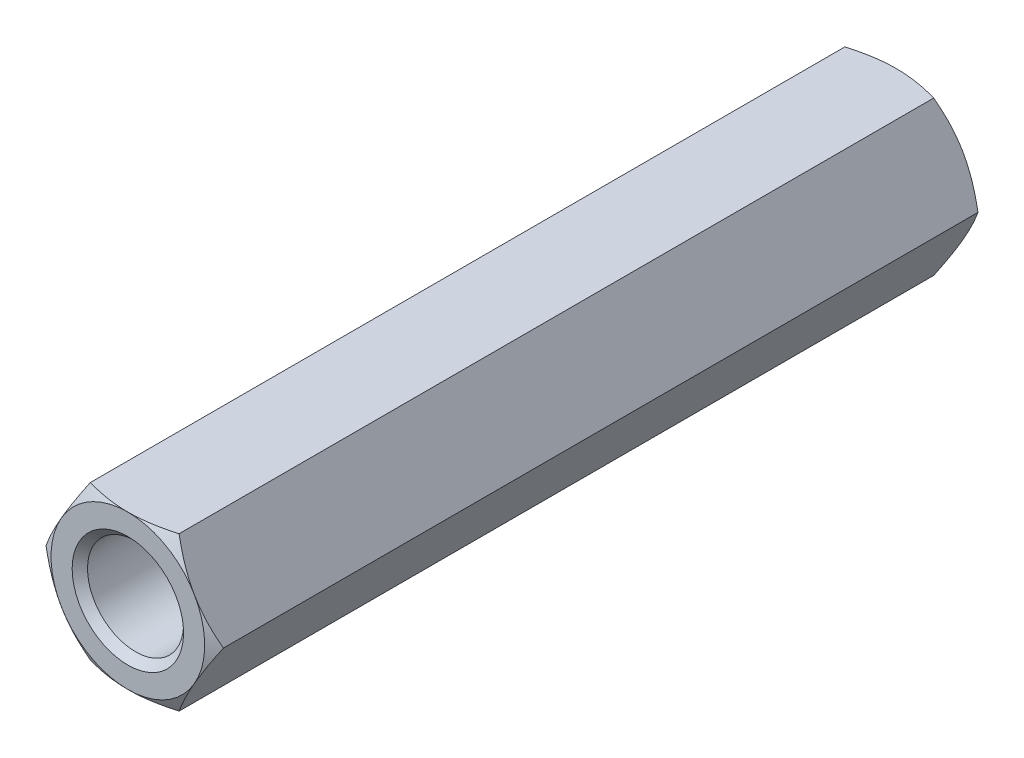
ISO-10303-21;
HEADER;
FILE_DESCRIPTION(('STEP AP214'),'2;1');
FILE_NAME('part.step','',(''),(''),'','','');
FILE_SCHEMA(('AUTOMOTIVE_DESIGN { 1 0 10303 214 1 1 1 1 }'));
ENDSEC;
DATA;
#1=APPLICATION_CONTEXT('core data for automotive mechanical design processes');
#2=APPLICATION_PROTOCOL_DEFINITION('international standard','automotive_design',2000,#1);
#3=PRODUCT_CONTEXT('',#1,'mechanical');
#4=PRODUCT('Part','Part','',(#3));
#5=PRODUCT_RELATED_PRODUCT_CATEGORY('part','',(#4));
#6=PRODUCT_DEFINITION_FORMATION('','',#4);
#7=PRODUCT_DEFINITION_CONTEXT('part definition',#1,'design');
#8=PRODUCT_DEFINITION('design','',#6,#7);
#9=PRODUCT_DEFINITION_SHAPE('','',#8);
#10=(LENGTH_UNIT() NAMED_UNIT(*) SI_UNIT(.MILLI.,.METRE.));
#11=(NAMED_UNIT(*) PLANE_ANGLE_UNIT() SI_UNIT($,.RADIAN.));
#12=(NAMED_UNIT(*) SI_UNIT($,.STERADIAN.) SOLID_ANGLE_UNIT());
#13=UNCERTAINTY_MEASURE_WITH_UNIT(LENGTH_MEASURE(1.E-05),#10,'distance_accuracy_value','');
#14=(GEOMETRIC_REPRESENTATION_CONTEXT(3) GLOBAL_UNCERTAINTY_ASSIGNED_CONTEXT((#13)) GLOBAL_UNIT_ASSIGNED_CONTEXT((#10,
#11,#12)) REPRESENTATION_CONTEXT('',''));
#15=CARTESIAN_POINT('',(0.,0.,0.));
#16=DIRECTION('',(0.,0.,1.));
#17=DIRECTION('',(1.,0.,0.));
#18=AXIS2_PLACEMENT_3D('',#15,#16,#17);
#19=CARTESIAN_POINT('',(4.61880215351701,0.,-20.));
#20=DIRECTION('',(0.866025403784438,0.5,0.));
#21=DIRECTION('',(-0.5,0.866025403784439,0.));
#22=AXIS2_PLACEMENT_3D('',#19,#20,#21);
#23=PLANE('',#22);
#24=CARTESIAN_POINT('',(4.61891762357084,-0.000199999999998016,19.6426677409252));
#25=CARTESIAN_POINT('',(4.51743148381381,0.17557915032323,19.7012821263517));
#26=CARTESIAN_POINT('',(4.41506932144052,0.352875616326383,19.7545896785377));
#27=CARTESIAN_POINT('',(4.20857250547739,0.710538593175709,19.8476383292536));
#28=CARTESIAN_POINT('',(4.10443418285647,0.890911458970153,19.8873465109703));
#29=CARTESIAN_POINT('',(3.89744813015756,1.24942181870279,19.9491577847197));
#30=CARTESIAN_POINT('',(3.79463224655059,1.42750415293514,19.9716722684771));
#31=CARTESIAN_POINT('',(3.58851671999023,1.78450671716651,19.9985493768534));
#32=CARTESIAN_POINT('',(3.48521782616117,1.9634256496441,20.0029342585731));
#33=CARTESIAN_POINT('',(3.29219970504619,2.29774284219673,19.99380992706));
#34=CARTESIAN_POINT('',(3.20245157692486,2.45319115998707,19.982541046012));
#35=CARTESIAN_POINT('',(3.02354002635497,2.76307505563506,19.9468260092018));
#36=CARTESIAN_POINT('',(2.93437722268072,2.91750956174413,19.9223676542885));
#37=CARTESIAN_POINT('',(2.75509682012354,3.22803232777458,19.8612239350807));
#38=CARTESIAN_POINT('',(2.6650019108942,3.3840812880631,19.8242793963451));
#39=CARTESIAN_POINT('',(2.48615580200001,3.69385183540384,19.740429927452));
#40=CARTESIAN_POINT('',(2.39740231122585,3.84757739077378,19.6935446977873));
#41=CARTESIAN_POINT('',(2.30928560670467,4.0002,19.6426677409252));
#42=B_SPLINE_CURVE_WITH_KNOTS('',3,(#24,#25,#26,#27,#28,#29,#30,#31,#32,#33,#34,#35,#36,#37,#38,
#39,#40,#41),.UNSPECIFIED.,.F.,.F.,(4,2,2,2,2,2,2,2,4),(0.,0.634047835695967,1.26961969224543,
1.88946157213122,2.50854226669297,3.04757825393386,3.58711366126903,4.13861653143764,
4.68903648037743),.UNSPECIFIED.);
#43=CARTESIAN_POINT('',(4.61880215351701,0.,19.6427344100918));
#44=VERTEX_POINT('',#43);
#45=CARTESIAN_POINT('',(3.46410161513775,2.,20.));
#46=VERTEX_POINT('',#45);
#47=EDGE_CURVE('E171',#44,#46,#42,.T.);
#48=ORIENTED_EDGE('',*,*,#47,.F.);
#49=DIRECTION('',(0.,0.,1.));
#50=VECTOR('',#49,1.);
#51=CARTESIAN_POINT('',(4.61880215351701,0.,-20.));
#52=LINE('',#51,#50);
#53=CARTESIAN_POINT('',(4.61880215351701,0.,-19.6427344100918));
#54=VERTEX_POINT('',#53);
#55=EDGE_CURVE('E318',#54,#44,#52,.T.);
#56=ORIENTED_EDGE('',*,*,#55,.F.);
#57=CARTESIAN_POINT('',(4.61891762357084,-0.000199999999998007,-19.6426677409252));
#58=CARTESIAN_POINT('',(4.51743148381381,0.17557915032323,-19.7012821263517));
#59=CARTESIAN_POINT('',(4.41506932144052,0.352875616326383,-19.7545896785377));
#60=CARTESIAN_POINT('',(4.20857250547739,0.710538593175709,-19.8476383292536));
#61=CARTESIAN_POINT('',(4.10443418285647,0.890911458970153,-19.8873465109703));
#62=CARTESIAN_POINT('',(3.89744813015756,1.24942181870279,-19.9491577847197));
#63=CARTESIAN_POINT('',(3.79463224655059,1.42750415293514,-19.9716722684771));
#64=CARTESIAN_POINT('',(3.58851671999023,1.78450671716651,-19.9985493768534));
#65=CARTESIAN_POINT('',(3.48521782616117,1.9634256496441,-20.0029342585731));
#66=CARTESIAN_POINT('',(3.29219970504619,2.29774284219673,-19.99380992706));
#67=CARTESIAN_POINT('',(3.20245157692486,2.45319115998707,-19.982541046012));
#68=CARTESIAN_POINT('',(3.02354002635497,2.76307505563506,-19.9468260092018));
#69=CARTESIAN_POINT('',(2.93437722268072,2.91750956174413,-19.9223676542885));
#70=CARTESIAN_POINT('',(2.75509682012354,3.22803232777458,-19.8612239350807));
#71=CARTESIAN_POINT('',(2.6650019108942,3.3840812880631,-19.8242793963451));
#72=CARTESIAN_POINT('',(2.48615580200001,3.69385183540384,-19.740429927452));
#73=CARTESIAN_POINT('',(2.39740231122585,3.84757739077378,-19.6935446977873));
#74=CARTESIAN_POINT('',(2.30928560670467,4.0002,-19.6426677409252));
#75=B_SPLINE_CURVE_WITH_KNOTS('',3,(#57,#58,#59,#60,#61,#62,#63,#64,#65,#66,#67,#68,#69,#70,#71,
#72,#73,#74),.UNSPECIFIED.,.F.,.F.,(4,2,2,2,2,2,2,2,4),(0.,0.634047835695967,1.26961969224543,
1.88946157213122,2.50854226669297,3.04757825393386,3.58711366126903,4.13861653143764,
4.68903648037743),.UNSPECIFIED.);
#76=CARTESIAN_POINT('',(3.46410161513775,2.,-20.));
#77=VERTEX_POINT('',#76);
#78=EDGE_CURVE('E305',#54,#77,#75,.T.);
#79=ORIENTED_EDGE('',*,*,#78,.T.);
#80=CARTESIAN_POINT('',(2.3094010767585,4.,-19.6427344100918));
#81=VERTEX_POINT('',#80);
#82=EDGE_CURVE('E252',#77,#81,#75,.T.);
#83=ORIENTED_EDGE('',*,*,#82,.T.);
#84=DIRECTION('',(0.,0.,1.));
#85=VECTOR('',#84,1.);
#86=CARTESIAN_POINT('',(2.3094010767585,4.,-20.));
#87=LINE('',#86,#85);
#88=CARTESIAN_POINT('',(2.3094010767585,4.,19.6427344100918));
#89=VERTEX_POINT('',#88);
#90=EDGE_CURVE('E348',#81,#89,#87,.T.);
#91=ORIENTED_EDGE('',*,*,#90,.T.);
#92=EDGE_CURVE('E147',#46,#89,#42,.T.);
#93=ORIENTED_EDGE('',*,*,#92,.F.);
#94=EDGE_LOOP('',(#48,#56,#79,#83,#91,#93));
#95=FACE_BOUND('',#94,.T.);
#96=ADVANCED_FACE('F41',(#95),#23,.T.);
#97=CARTESIAN_POINT('',(2.3094010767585,-4.,-20.));
#98=DIRECTION('',(0.866025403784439,-0.5,0.));
#99=DIRECTION('',(0.5,0.866025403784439,0.));
#100=AXIS2_PLACEMENT_3D('',#97,#98,#99);
#101=PLANE('',#100);
#102=CARTESIAN_POINT('',(2.30928560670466,-4.0002,19.6426677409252));
#103=CARTESIAN_POINT('',(2.4107717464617,-3.82442084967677,19.7012821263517));
#104=CARTESIAN_POINT('',(2.51313390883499,-3.64712438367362,19.7545896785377));
#105=CARTESIAN_POINT('',(2.71963072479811,-3.28946140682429,19.8476383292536));
#106=CARTESIAN_POINT('',(2.82376904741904,-3.10908854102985,19.8873465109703));
#107=CARTESIAN_POINT('',(3.03075510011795,-2.75057818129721,19.9491577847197));
#108=CARTESIAN_POINT('',(3.13357098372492,-2.57249584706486,19.9716722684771));
#109=CARTESIAN_POINT('',(3.33968651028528,-2.21549328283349,19.9985493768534));
#110=CARTESIAN_POINT('',(3.44298540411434,-2.0365743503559,20.0029342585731));
#111=CARTESIAN_POINT('',(3.63600352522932,-1.70225715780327,19.99380992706));
#112=CARTESIAN_POINT('',(3.72575165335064,-1.54680884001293,19.982541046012));
#113=CARTESIAN_POINT('',(3.90466320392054,-1.23692494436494,19.9468260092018));
#114=CARTESIAN_POINT('',(3.99382600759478,-1.08249043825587,19.9223676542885));
#115=CARTESIAN_POINT('',(4.17310641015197,-0.771967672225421,19.8612239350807));
#116=CARTESIAN_POINT('',(4.26320131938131,-0.615918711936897,19.8242793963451));
#117=CARTESIAN_POINT('',(4.4420474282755,-0.30614816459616,19.740429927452));
#118=CARTESIAN_POINT('',(4.53080091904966,-0.152422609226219,19.6935446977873));
#119=CARTESIAN_POINT('',(4.61891762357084,0.000200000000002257,19.6426677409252));
#120=B_SPLINE_CURVE_WITH_KNOTS('',3,(#102,#103,#104,#105,#106,#107,#108,#109,#110,#111,#112,
#113,#114,#115,#116,#117,#118,#119),.UNSPECIFIED.,.F.,.F.,(4,2,2,2,2,2,2,2,4),(0.,
0.634047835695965,1.26961969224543,1.88946157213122,2.50854226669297,3.04757825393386,
3.58711366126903,4.13861653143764,4.68903648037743),.UNSPECIFIED.);
#121=CARTESIAN_POINT('',(2.3094010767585,-4.,19.6427344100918));
#122=VERTEX_POINT('',#121);
#123=CARTESIAN_POINT('',(3.46410161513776,-2.,20.));
#124=VERTEX_POINT('',#123);
#125=EDGE_CURVE('E407',#122,#124,#120,.T.);
#126=ORIENTED_EDGE('',*,*,#125,.F.);
#127=DIRECTION('',(0.,0.,1.));
#128=VECTOR('',#127,1.);
#129=CARTESIAN_POINT('',(2.3094010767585,-4.,-20.));
#130=LINE('',#129,#128);
#131=CARTESIAN_POINT('',(2.3094010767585,-4.,-19.6427344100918));
#132=VERTEX_POINT('',#131);
#133=EDGE_CURVE('E401',#132,#122,#130,.T.);
#134=ORIENTED_EDGE('',*,*,#133,.F.);
#135=CARTESIAN_POINT('',(2.30928560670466,-4.0002,-19.6426677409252));
#136=CARTESIAN_POINT('',(2.4107717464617,-3.82442084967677,-19.7012821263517));
#137=CARTESIAN_POINT('',(2.51313390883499,-3.64712438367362,-19.7545896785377));
#138=CARTESIAN_POINT('',(2.71963072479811,-3.28946140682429,-19.8476383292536));
#139=CARTESIAN_POINT('',(2.82376904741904,-3.10908854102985,-19.8873465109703));
#140=CARTESIAN_POINT('',(3.03075510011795,-2.75057818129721,-19.9491577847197));
#141=CARTESIAN_POINT('',(3.13357098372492,-2.57249584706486,-19.9716722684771));
#142=CARTESIAN_POINT('',(3.33968651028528,-2.21549328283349,-19.9985493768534));
#143=CARTESIAN_POINT('',(3.44298540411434,-2.0365743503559,-20.0029342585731));
#144=CARTESIAN_POINT('',(3.63600352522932,-1.70225715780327,-19.99380992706));
#145=CARTESIAN_POINT('',(3.72575165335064,-1.54680884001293,-19.982541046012));
#146=CARTESIAN_POINT('',(3.90466320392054,-1.23692494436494,-19.9468260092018));
#147=CARTESIAN_POINT('',(3.99382600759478,-1.08249043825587,-19.9223676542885));
#148=CARTESIAN_POINT('',(4.17310641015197,-0.771967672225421,-19.8612239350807));
#149=CARTESIAN_POINT('',(4.26320131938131,-0.615918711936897,-19.8242793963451));
#150=CARTESIAN_POINT('',(4.4420474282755,-0.30614816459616,-19.740429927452));
#151=CARTESIAN_POINT('',(4.53080091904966,-0.152422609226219,-19.6935446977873));
#152=CARTESIAN_POINT('',(4.61891762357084,0.000200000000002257,-19.6426677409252));
#153=B_SPLINE_CURVE_WITH_KNOTS('',3,(#135,#136,#137,#138,#139,#140,#141,#142,#143,#144,#145,
#146,#147,#148,#149,#150,#151,#152),.UNSPECIFIED.,.F.,.F.,(4,2,2,2,2,2,2,2,4),(0.,
0.634047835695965,1.26961969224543,1.88946157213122,2.50854226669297,3.04757825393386,
3.58711366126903,4.13861653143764,4.68903648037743),.UNSPECIFIED.);
#154=CARTESIAN_POINT('',(3.46410161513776,-2.,-20.));
#155=VERTEX_POINT('',#154);
#156=EDGE_CURVE('E333',#132,#155,#153,.T.);
#157=ORIENTED_EDGE('',*,*,#156,.T.);
#158=EDGE_CURVE('E249',#155,#54,#153,.T.);
#159=ORIENTED_EDGE('',*,*,#158,.T.);
#160=ORIENTED_EDGE('',*,*,#55,.T.);
#161=EDGE_CURVE('E175',#124,#44,#120,.T.);
#162=ORIENTED_EDGE('',*,*,#161,.F.);
#163=EDGE_LOOP('',(#126,#134,#157,#159,#160,#162));
#164=FACE_BOUND('',#163,.T.);
#165=ADVANCED_FACE('F330',(#164),#101,.T.);
#166=CARTESIAN_POINT('',(-2.3094010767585,-4.,-20.));
#167=DIRECTION('',(0.,-1.,0.));
#168=DIRECTION('',(0.,0.,-1.));
#169=AXIS2_PLACEMENT_3D('',#166,#167,#168);
#170=PLANE('',#169);
#171=CARTESIAN_POINT('',(-31.3494258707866,-4.,4.0630635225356));
#172=CARTESIAN_POINT('',(-30.6832696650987,-4.,4.44457451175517));
#173=CARTESIAN_POINT('',(-30.0170312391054,-4.,4.82594185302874));
#174=CARTESIAN_POINT('',(-28.6843491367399,-4.,5.58831840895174));
#175=CARTESIAN_POINT('',(-28.0179054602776,-4.,5.96932762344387));
#176=CARTESIAN_POINT('',(-26.0181599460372,-4.,7.11173776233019));
#177=CARTESIAN_POINT('',(-24.6844898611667,-4.,7.87249468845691));
#178=CARTESIAN_POINT('',(-22.6812225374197,-4.,9.01246757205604));
#179=CARTESIAN_POINT('',(-22.0122120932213,-4.,9.39271461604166));
#180=CARTESIAN_POINT('',(-20.6736740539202,-4.,10.1522972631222));
#181=CARTESIAN_POINT('',(-20.0041464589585,-4.,10.5316328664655));
#182=CARTESIAN_POINT('',(-18.6644222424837,-4.,11.2890830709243));
#183=CARTESIAN_POINT('',(-17.9942256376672,-4.,11.6671977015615));
#184=CARTESIAN_POINT('',(-16.6528970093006,-4.,12.4217635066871));
#185=CARTESIAN_POINT('',(-15.9817649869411,-4.,12.7982146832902));
#186=CARTESIAN_POINT('',(-14.6381204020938,-4.,13.5487751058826));
#187=CARTESIAN_POINT('',(-13.9656077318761,-4.,13.9228841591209));
#188=CARTESIAN_POINT('',(-12.6186015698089,-4.,14.6676077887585));
#189=CARTESIAN_POINT('',(-11.944107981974,-4.,15.0382221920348));
#190=CARTESIAN_POINT('',(-10.9304593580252,-4.,15.5897187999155));
#191=CARTESIAN_POINT('',(-10.5924524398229,-4.,15.7727100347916));
#192=CARTESIAN_POINT('',(-9.91545112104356,-4.,16.1368552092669));
#193=CARTESIAN_POINT('',(-9.57645672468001,-4.,16.3180091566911));
#194=CARTESIAN_POINT('',(-8.89721386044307,-4.,16.6778773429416));
#195=CARTESIAN_POINT('',(-8.55696551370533,-4.,16.85659180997));
#196=CARTESIAN_POINT('',(-7.87476142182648,-4.,17.2107230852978));
#197=CARTESIAN_POINT('',(-7.53280570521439,-4.,17.3861399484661));
#198=CARTESIAN_POINT('',(-6.84732082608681,-4.,17.7319948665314));
#199=CARTESIAN_POINT('',(-6.50379681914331,-4.,17.9024430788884));
#200=CARTESIAN_POINT('',(-5.98604630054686,-4.,18.1531205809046));
#201=CARTESIAN_POINT('',(-5.81303364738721,-4.,18.2358557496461));
#202=CARTESIAN_POINT('',(-5.46603924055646,-4.,18.3992654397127));
#203=CARTESIAN_POINT('',(-5.29205750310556,-4.,18.4799399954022));
#204=CARTESIAN_POINT('',(-4.94223283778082,-4.,18.6390688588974));
#205=CARTESIAN_POINT('',(-4.76638523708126,-4.,18.7175129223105));
#206=CARTESIAN_POINT('',(-4.41329909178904,-4.,18.8711966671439));
#207=CARTESIAN_POINT('',(-4.23606060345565,-4.,18.9464364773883));
#208=CARTESIAN_POINT('',(-3.87994451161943,-4.,19.0928636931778));
#209=CARTESIAN_POINT('',(-3.70106720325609,-4.,19.1640518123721));
#210=CARTESIAN_POINT('',(-3.34135714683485,-4.,19.3012759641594));
#211=CARTESIAN_POINT('',(-3.16052456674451,-4.,19.3673124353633));
#212=CARTESIAN_POINT('',(-2.74883557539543,-4.,19.509276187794));
#213=CARTESIAN_POINT('',(-2.51729566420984,-4.,19.583256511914));
#214=CARTESIAN_POINT('',(-2.05008026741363,-4.,19.7169956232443));
#215=CARTESIAN_POINT('',(-1.81440493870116,-4.,19.7767549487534));
#216=CARTESIAN_POINT('',(-1.34150030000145,-4.,19.8768440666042));
#217=CARTESIAN_POINT('',(-1.10431648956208,-4.,19.9173800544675));
#218=CARTESIAN_POINT('',(-0.746521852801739,-4.,19.9610935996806));
#219=CARTESIAN_POINT('',(-0.626929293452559,-4.,19.9728161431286));
#220=CARTESIAN_POINT('',(-0.387295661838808,-4.,19.990213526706));
#221=CARTESIAN_POINT('',(-0.267254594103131,-4.,19.9958884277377));
#222=CARTESIAN_POINT('',(-0.0259340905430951,-4.,20.0010108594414));
#223=CARTESIAN_POINT('',(0.0953465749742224,-4.,20.0004005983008));
#224=CARTESIAN_POINT('',(0.337708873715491,-4.,19.9928371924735));
#225=CARTESIAN_POINT('',(0.458790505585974,-4.,19.985884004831));
#226=CARTESIAN_POINT('',(0.700474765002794,-4.,19.9658742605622));
#227=CARTESIAN_POINT('',(0.821077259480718,-4.,19.9528161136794));
#228=CARTESIAN_POINT('',(1.06152579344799,-4.,19.9210169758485));
#229=CARTESIAN_POINT('',(1.18137181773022,-4.,19.9022758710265));
#230=CARTESIAN_POINT('',(1.421549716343,-4.,19.8593941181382));
#231=CARTESIAN_POINT('',(1.54187056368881,-4.,19.8351922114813));
#232=CARTESIAN_POINT('',(1.78147254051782,-4.,19.7821231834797));
#233=CARTESIAN_POINT('',(1.90075365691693,-4.,19.7532560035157));
#234=CARTESIAN_POINT('',(2.13826215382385,-4.,19.6914552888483));
#235=CARTESIAN_POINT('',(2.25648944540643,-4.,19.6585214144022));
#236=CARTESIAN_POINT('',(2.49189742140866,-4.,19.5891487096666));
#237=CARTESIAN_POINT('',(2.60907816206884,-4.,19.5527100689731));
#238=CARTESIAN_POINT('',(2.95539006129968,-4.,19.4401252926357));
#239=CARTESIAN_POINT('',(3.18312360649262,-4.,19.3596766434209));
#240=CARTESIAN_POINT('',(3.63542707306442,-4.,19.19028066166));
#241=CARTESIAN_POINT('',(3.85999608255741,-4.,19.101330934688));
#242=CARTESIAN_POINT('',(4.30674919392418,-4.,18.9170740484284));
#243=CARTESIAN_POINT('',(4.52893078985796,-4.,18.8217608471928));
#244=CARTESIAN_POINT('',(4.97118524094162,-4.,18.6264484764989));
#245=CARTESIAN_POINT('',(5.19125831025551,-4.,18.5264497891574));
#246=CARTESIAN_POINT('',(5.63034843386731,-4.,18.3225996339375));
#247=CARTESIAN_POINT('',(5.84936087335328,-4.,18.2187382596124));
#248=CARTESIAN_POINT('',(6.28604922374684,-4.,18.0082389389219));
#249=CARTESIAN_POINT('',(6.50372510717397,-4.,17.901600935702));
#250=CARTESIAN_POINT('',(6.93787555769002,-4.,17.686205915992));
#251=CARTESIAN_POINT('',(7.15435071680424,-4.,17.5774500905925));
#252=CARTESIAN_POINT('',(7.58641962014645,-4.,17.3581998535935));
#253=CARTESIAN_POINT('',(7.80201335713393,-4.,17.2477054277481));
#254=CARTESIAN_POINT('',(8.44949556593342,-4.,16.9132140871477));
#255=CARTESIAN_POINT('',(8.88029279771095,-4.,16.6871057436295));
#256=CARTESIAN_POINT('',(9.73993233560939,-4.,16.231086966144));
#257=CARTESIAN_POINT('',(10.1687743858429,-4.,16.0011760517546));
#258=CARTESIAN_POINT('',(11.0242662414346,-4.,15.5390817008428));
#259=CARTESIAN_POINT('',(11.4509185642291,-4.,15.3069029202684));
#260=CARTESIAN_POINT('',(12.3031376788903,-4.,14.8406036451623));
#261=CARTESIAN_POINT('',(12.7287045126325,-4.,14.6064832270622));
#262=CARTESIAN_POINT('',(13.9227685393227,-4.,13.9469248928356));
#263=CARTESIAN_POINT('',(14.6903548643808,-4.,13.5198387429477));
#264=CARTESIAN_POINT('',(16.223871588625,-4.,12.6626821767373));
#265=CARTESIAN_POINT('',(16.9898019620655,-4.,12.2326117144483));
#266=CARTESIAN_POINT('',(18.5210474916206,-4.,11.3701614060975));
#267=CARTESIAN_POINT('',(19.2863618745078,-4.,10.9377801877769));
#268=CARTESIAN_POINT('',(20.8161877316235,-4.,10.0715995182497));
#269=CARTESIAN_POINT('',(21.5806992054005,-4.,9.63780006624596));
#270=CARTESIAN_POINT('',(23.0963844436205,-4.,8.77641090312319));
#271=CARTESIAN_POINT('',(23.8475679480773,-4.,8.348838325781));
#272=CARTESIAN_POINT('',(25.3495050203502,-4.,7.49293601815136));
#273=CARTESIAN_POINT('',(26.1002585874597,-4.,7.06460628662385));
#274=CARTESIAN_POINT('',(27.6008982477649,-4.,6.20766897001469));
#275=CARTESIAN_POINT('',(28.3507845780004,-4.,5.77906179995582));
#276=CARTESIAN_POINT('',(29.8502892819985,-4.,4.92138249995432));
#277=CARTESIAN_POINT('',(30.5999076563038,-4.,4.49231037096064));
#278=CARTESIAN_POINT('',(31.3494258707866,-4.,4.0630635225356));
#279=B_SPLINE_CURVE_WITH_KNOTS('',3,(#171,#172,#173,#174,#175,#176,#177,#178,#179,#180,#181,
#182,#183,#184,#185,#186,#187,#188,#189,#190,#191,#192,#193,#194,#195,#196,#197,#198,#199,#200,
#201,#202,#203,#204,#205,#206,#207,#208,#209,#210,#211,#212,#213,#214,#215,#216,#217,#218,#219,
#220,#221,#222,#223,#224,#225,#226,#227,#228,#229,#230,#231,#232,#233,#234,#235,#236,#237,#238,
#239,#240,#241,#242,#243,#244,#245,#246,#247,#248,#249,#250,#251,#252,#253,#254,#255,#256,#257,
#258,#259,#260,#261,#262,#263,#264,#265,#266,#267,#268,#269,#270,#271,#272,#273,#274,#275,#276,
#277,#278),.UNSPECIFIED.,.F.,.F.,(4,2,2,2,2,2,2,2,2,2,2,2,2,2,2,2,2,2,2,2,2,2,2,2,2,2,2,2,2,2,2,
2,2,2,2,2,2,2,2,2,2,2,2,2,2,2,2,2,2,2,2,2,2,4),(0.,2.30300498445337,4.60601097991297,
9.2121828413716,11.5207457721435,13.8293080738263,16.1378141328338,18.4463172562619,
20.7550079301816,23.0638123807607,24.2168954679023,25.3699736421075,26.5229432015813,
27.6758935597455,28.8262928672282,29.4016140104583,29.9769255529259,30.55455290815,
31.1321570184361,31.7096590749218,32.2871119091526,33.0159821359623,33.7448247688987,
34.4656621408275,34.8260282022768,35.1863906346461,35.5500695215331,35.9137508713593,
36.2775270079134,36.6413104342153,37.0093977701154,37.3774897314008,37.7456124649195,
38.1137152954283,38.8380277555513,39.5625448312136,40.2877598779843,41.0129004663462,
41.7400500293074,42.4672144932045,43.1939811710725,43.9207538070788,45.3803105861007,
46.8400531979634,48.2972531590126,49.7543960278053,52.3895917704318,55.0248281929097,
57.6618577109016,60.298888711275,62.8919278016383,65.4849711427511,68.0761680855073,
70.6673597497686),.UNSPECIFIED.);
#280=CARTESIAN_POINT('',(-2.3094010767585,-4.,19.6427344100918));
#281=VERTEX_POINT('',#280);
#282=CARTESIAN_POINT('',(0.,-4.,20.));
#283=VERTEX_POINT('',#282);
#284=EDGE_CURVE('E395',#281,#283,#279,.T.);
#285=ORIENTED_EDGE('',*,*,#284,.F.);
#286=DIRECTION('',(0.,0.,1.));
#287=VECTOR('',#286,1.);
#288=CARTESIAN_POINT('',(-2.3094010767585,-4.,-20.));
#289=LINE('',#288,#287);
#290=CARTESIAN_POINT('',(-2.3094010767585,-4.,-19.6427344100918));
#291=VERTEX_POINT('',#290);
#292=EDGE_CURVE('E396',#291,#281,#289,.T.);
#293=ORIENTED_EDGE('',*,*,#292,.F.);
#294=CARTESIAN_POINT('',(-17.8108056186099,-4.,-11.7701917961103));
#295=CARTESIAN_POINT('',(-17.4231435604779,-4.,-11.9885612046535));
#296=CARTESIAN_POINT('',(-17.0353413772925,-4.,-12.2066823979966));
#297=CARTESIAN_POINT('',(-16.2593791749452,-4.,-12.6422907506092));
#298=CARTESIAN_POINT('',(-15.8712191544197,-4.,-12.8597779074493));
#299=CARTESIAN_POINT('',(-15.0943874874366,-4.,-13.294023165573));
#300=CARTESIAN_POINT('',(-14.7057157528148,-4.,-13.5107811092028));
#301=CARTESIAN_POINT('',(-13.9278336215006,-4.,-13.9433271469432));
#302=CARTESIAN_POINT('',(-13.5386232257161,-4.,-14.1591152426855));
#303=CARTESIAN_POINT('',(-12.7617286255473,-4.,-14.5882397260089));
#304=CARTESIAN_POINT('',(-12.3740482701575,-4.,-14.8015830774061));
#305=CARTESIAN_POINT('',(-11.5978227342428,-4.,-15.2266901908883));
#306=CARTESIAN_POINT('',(-11.2092775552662,-4.,-15.4384539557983));
#307=CARTESIAN_POINT('',(-10.431096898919,-4.,-15.8598651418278));
#308=CARTESIAN_POINT('',(-10.0414615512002,-4.,-16.0695128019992));
#309=CARTESIAN_POINT('',(-9.26067086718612,-4.,-16.4859521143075));
#310=CARTESIAN_POINT('',(-8.86951554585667,-4.,-16.6927437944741));
#311=CARTESIAN_POINT('',(-8.07519273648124,-4.,-17.1075077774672));
#312=CARTESIAN_POINT('',(-7.67197156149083,-4.,-17.3153777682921));
#313=CARTESIAN_POINT('',(-7.06472102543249,-4.,-17.6225092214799));
#314=CARTESIAN_POINT('',(-6.86187947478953,-4.,-17.7241179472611));
#315=CARTESIAN_POINT('',(-6.4552286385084,-4.,-17.9253778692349));
#316=CARTESIAN_POINT('',(-6.25141936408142,-4.,-18.0250290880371));
#317=CARTESIAN_POINT('',(-5.84125807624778,-4.,-18.2225356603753));
#318=CARTESIAN_POINT('',(-5.63489816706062,-4.,-18.3203746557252));
#319=CARTESIAN_POINT('',(-5.22070788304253,-4.,-18.512881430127));
#320=CARTESIAN_POINT('',(-5.01287755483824,-4.,-18.6075493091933));
#321=CARTESIAN_POINT('',(-4.59543688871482,-4.,-18.7927648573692));
#322=CARTESIAN_POINT('',(-4.38582696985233,-4.,-18.8833134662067));
#323=CARTESIAN_POINT('',(-3.96436954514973,-4.,-19.0590180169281));
#324=CARTESIAN_POINT('',(-3.75252223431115,-4.,-19.1441744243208));
#325=CARTESIAN_POINT('',(-3.29653652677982,-4.,-19.3186353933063));
#326=CARTESIAN_POINT('',(-3.05198777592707,-4.,-19.4068822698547));
#327=CARTESIAN_POINT('',(-2.55851043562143,-4.,-19.5704753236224));
#328=CARTESIAN_POINT('',(-2.3095812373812,-4.,-19.6458196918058));
#329=CARTESIAN_POINT('',(-1.81007791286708,-4.,-19.7777417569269));
#330=CARTESIAN_POINT('',(-1.55956719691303,-4.,-19.8345505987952));
#331=CARTESIAN_POINT('',(-1.18075305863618,-4.,-19.9024834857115));
#332=CARTESIAN_POINT('',(-1.05398563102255,-4.,-19.9222466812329));
#333=CARTESIAN_POINT('',(-0.799627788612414,-4.,-19.9553923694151));
#334=CARTESIAN_POINT('',(-0.672037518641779,-4.,-19.9687759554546));
#335=CARTESIAN_POINT('',(-0.41393979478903,-4.,-19.9888624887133));
#336=CARTESIAN_POINT('',(-0.283422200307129,-4.,-19.9954366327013));
#337=CARTESIAN_POINT('',(-0.0222228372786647,-4.,-20.0011936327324));
#338=CARTESIAN_POINT('',(0.108458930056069,-4.,-20.0003765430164));
#339=CARTESIAN_POINT('',(0.369574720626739,-4.,-19.99138493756));
#340=CARTESIAN_POINT('',(0.500008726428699,-4.,-19.9832099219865));
#341=CARTESIAN_POINT('',(0.76024119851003,-4.,-19.95983097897));
#342=CARTESIAN_POINT('',(0.890039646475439,-4.,-19.9446268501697));
#343=CARTESIAN_POINT('',(1.15029888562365,-4.,-19.907521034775));
#344=CARTESIAN_POINT('',(1.28074811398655,-4.,-19.8855390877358));
#345=CARTESIAN_POINT('',(1.54050277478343,-4.,-19.8356630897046));
#346=CARTESIAN_POINT('',(1.66980818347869,-4.,-19.8077689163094));
#347=CARTESIAN_POINT('',(1.92724730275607,-4.,-19.7468186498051));
#348=CARTESIAN_POINT('',(2.05538047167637,-4.,-19.7137602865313));
#349=CARTESIAN_POINT('',(2.31040843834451,-4.,-19.6432261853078));
#350=CARTESIAN_POINT('',(2.43730329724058,-4.,-19.6057506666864));
#351=CARTESIAN_POINT('',(2.77800839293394,-4.,-19.4996157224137));
#352=CARTESIAN_POINT('',(2.99072077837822,-4.,-19.4274343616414));
#353=CARTESIAN_POINT('',(3.41324611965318,-4.,-19.2749839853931));
#354=CARTESIAN_POINT('',(3.62305827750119,-4.,-19.1947127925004));
#355=CARTESIAN_POINT('',(4.0404398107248,-4.,-19.0280175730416));
#356=CARTESIAN_POINT('',(4.2480068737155,-4.,-18.9415877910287));
#357=CARTESIAN_POINT('',(4.66112607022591,-4.,-18.7641193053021));
#358=CARTESIAN_POINT('',(4.86667839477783,-4.,-18.6730810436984));
#359=CARTESIAN_POINT('',(5.27669988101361,-4.,-18.4872109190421));
#360=CARTESIAN_POINT('',(5.48116483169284,-4.,-18.3923697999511));
#361=CARTESIAN_POINT('',(5.88877966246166,-4.,-18.1999005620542));
#362=CARTESIAN_POINT('',(6.09192951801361,-4.,-18.1022723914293));
#363=CARTESIAN_POINT('',(6.49704451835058,-4.,-17.9048658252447));
#364=CARTESIAN_POINT('',(6.69901024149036,-4.,-17.8050886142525));
#365=CARTESIAN_POINT('',(7.10205847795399,-4.,-17.6037642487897));
#366=CARTESIAN_POINT('',(7.30314098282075,-4.,-17.5022170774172));
#367=CARTESIAN_POINT('',(7.90688497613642,-4.,-17.1946292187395));
#368=CARTESIAN_POINT('',(8.30844516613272,-4.,-16.9864277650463));
#369=CARTESIAN_POINT('',(9.10956165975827,-4.,-16.5661048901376));
#370=CARTESIAN_POINT('',(9.50911771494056,-4.,-16.3539829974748));
#371=CARTESIAN_POINT('',(10.3061197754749,-4.,-15.9272932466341));
#372=CARTESIAN_POINT('',(10.7035680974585,-4.,-15.7127297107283));
#373=CARTESIAN_POINT('',(11.4973607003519,-4.,-15.2815695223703));
#374=CARTESIAN_POINT('',(11.8937049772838,-4.,-15.064972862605));
#375=CARTESIAN_POINT('',(12.7529183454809,-4.,-14.5932633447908));
#376=CARTESIAN_POINT('',(13.2156320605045,-4.,-14.3378676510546));
#377=CARTESIAN_POINT('',(14.1403827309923,-4.,-13.8254233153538));
#378=CARTESIAN_POINT('',(14.6024193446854,-4.,-13.5683740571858));
#379=CARTESIAN_POINT('',(15.5225586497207,-4.,-13.0549258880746));
#380=CARTESIAN_POINT('',(15.9806659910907,-4.,-12.798535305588));
#381=CARTESIAN_POINT('',(16.8961808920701,-4.,-12.2849393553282));
#382=CARTESIAN_POINT('',(17.3535886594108,-4.,-12.027734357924));
#383=CARTESIAN_POINT('',(17.8108056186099,-4.,-11.7701917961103));
#384=B_SPLINE_CURVE_WITH_KNOTS('',3,(#294,#295,#296,#297,#298,#299,#300,#301,#302,#303,#304,
#305,#306,#307,#308,#309,#310,#311,#312,#313,#314,#315,#316,#317,#318,#319,#320,#321,#322,#323,
#324,#325,#326,#327,#328,#329,#330,#331,#332,#333,#334,#335,#336,#337,#338,#339,#340,#341,#342,
#343,#344,#345,#346,#347,#348,#349,#350,#351,#352,#353,#354,#355,#356,#357,#358,#359,#360,#361,
#362,#363,#364,#365,#366,#367,#368,#369,#370,#371,#372,#373,#374,#375,#376,#377,#378,#379,#380,
#381,#382,#383),.UNSPECIFIED.,.F.,.F.,(4,2,2,2,2,2,2,2,2,2,2,2,2,2,2,2,2,2,2,2,2,2,2,2,2,2,2,2,
2,2,2,2,2,2,2,2,2,2,2,2,2,2,2,2,4),(0.,1.33480502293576,2.6696151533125,4.00469738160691,
5.33977736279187,6.66729215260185,7.9948045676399,9.32216529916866,10.6495129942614,
12.0104163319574,12.6910119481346,13.3715996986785,14.0567152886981,14.7418092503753,
15.4267461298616,16.1116237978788,16.8913116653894,17.6711087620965,18.4407726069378,
18.8255327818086,19.2102269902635,19.6020718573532,19.9939138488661,20.3857824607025,
20.7776622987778,21.1743734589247,21.5710928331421,21.9679870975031,22.3648616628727,
23.0384953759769,23.7123108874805,24.3867645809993,25.0611536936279,25.737297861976,
26.4134546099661,27.0892477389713,27.7650473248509,29.1219872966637,30.4790915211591,
31.8340828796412,33.1890791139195,34.7746279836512,36.3608065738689,37.9357296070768,
39.5100173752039),.UNSPECIFIED.);
#385=CARTESIAN_POINT('',(0.,-4.,-20.));
#386=VERTEX_POINT('',#385);
#387=EDGE_CURVE('E343',#291,#386,#384,.T.);
#388=ORIENTED_EDGE('',*,*,#387,.T.);
#389=EDGE_CURVE('E277',#386,#132,#384,.T.);
#390=ORIENTED_EDGE('',*,*,#389,.T.);
#391=ORIENTED_EDGE('',*,*,#133,.T.);
#392=EDGE_CURVE('E211',#283,#122,#279,.T.);
#393=ORIENTED_EDGE('',*,*,#392,.F.);
#394=EDGE_LOOP('',(#285,#293,#388,#390,#391,#393));
#395=FACE_BOUND('',#394,.T.);
#396=ADVANCED_FACE('F234',(#395),#170,.T.);
#397=CARTESIAN_POINT('',(-4.61880215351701,0.,-20.));
#398=DIRECTION('',(-0.866025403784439,-0.5,0.));
#399=DIRECTION('',(0.5,-0.866025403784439,0.));
#400=AXIS2_PLACEMENT_3D('',#397,#398,#399);
#401=PLANE('',#400);
#402=CARTESIAN_POINT('',(-4.61891762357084,0.000200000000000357,19.6426677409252));
#403=CARTESIAN_POINT('',(-4.51743148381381,-0.175579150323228,19.7012821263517));
#404=CARTESIAN_POINT('',(-4.41506932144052,-0.352875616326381,19.7545896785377));
#405=CARTESIAN_POINT('',(-4.20857250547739,-0.710538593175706,19.8476383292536));
#406=CARTESIAN_POINT('',(-4.10443418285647,-0.890911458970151,19.8873465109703));
#407=CARTESIAN_POINT('',(-3.89744813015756,-1.24942181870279,19.9491577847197));
#408=CARTESIAN_POINT('',(-3.79463224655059,-1.42750415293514,19.9716722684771));
#409=CARTESIAN_POINT('',(-3.58851671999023,-1.78450671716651,19.9985493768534));
#410=CARTESIAN_POINT('',(-3.48521782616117,-1.9634256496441,20.0029342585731));
#411=CARTESIAN_POINT('',(-3.29219970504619,-2.29774284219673,19.99380992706));
#412=CARTESIAN_POINT('',(-3.20245157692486,-2.45319115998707,19.982541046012));
#413=CARTESIAN_POINT('',(-3.02354002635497,-2.76307505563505,19.9468260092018));
#414=CARTESIAN_POINT('',(-2.93437722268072,-2.91750956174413,19.9223676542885));
#415=CARTESIAN_POINT('',(-2.75509682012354,-3.22803232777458,19.8612239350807));
#416=CARTESIAN_POINT('',(-2.6650019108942,-3.3840812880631,19.8242793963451));
#417=CARTESIAN_POINT('',(-2.48615580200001,-3.69385183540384,19.740429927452));
#418=CARTESIAN_POINT('',(-2.39740231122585,-3.84757739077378,19.6935446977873));
#419=CARTESIAN_POINT('',(-2.30928560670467,-4.0002,19.6426677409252));
#420=B_SPLINE_CURVE_WITH_KNOTS('',3,(#402,#403,#404,#405,#406,#407,#408,#409,#410,#411,#412,
#413,#414,#415,#416,#417,#418,#419),.UNSPECIFIED.,.F.,.F.,(4,2,2,2,2,2,2,2,4),(0.,
0.634047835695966,1.26961969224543,1.88946157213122,2.50854226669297,3.04757825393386,
3.58711366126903,4.13861653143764,4.68903648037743),.UNSPECIFIED.);
#421=CARTESIAN_POINT('',(-4.61880215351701,0.,19.6427344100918));
#422=VERTEX_POINT('',#421);
#423=CARTESIAN_POINT('',(-3.46410161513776,-2.,20.));
#424=VERTEX_POINT('',#423);
#425=EDGE_CURVE('E156',#422,#424,#420,.T.);
#426=ORIENTED_EDGE('',*,*,#425,.F.);
#427=DIRECTION('',(0.,0.,1.));
#428=VECTOR('',#427,1.);
#429=CARTESIAN_POINT('',(-4.61880215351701,0.,-20.));
#430=LINE('',#429,#428);
#431=CARTESIAN_POINT('',(-4.61880215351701,0.,-19.6427344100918));
#432=VERTEX_POINT('',#431);
#433=EDGE_CURVE('E169',#432,#422,#430,.T.);
#434=ORIENTED_EDGE('',*,*,#433,.F.);
#435=CARTESIAN_POINT('',(-4.61891762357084,0.000200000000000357,-19.6426677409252));
#436=CARTESIAN_POINT('',(-4.51743148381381,-0.175579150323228,-19.7012821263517));
#437=CARTESIAN_POINT('',(-4.41506932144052,-0.352875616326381,-19.7545896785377));
#438=CARTESIAN_POINT('',(-4.20857250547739,-0.710538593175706,-19.8476383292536));
#439=CARTESIAN_POINT('',(-4.10443418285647,-0.890911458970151,-19.8873465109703));
#440=CARTESIAN_POINT('',(-3.89744813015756,-1.24942181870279,-19.9491577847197));
#441=CARTESIAN_POINT('',(-3.79463224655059,-1.42750415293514,-19.9716722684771));
#442=CARTESIAN_POINT('',(-3.58851671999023,-1.78450671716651,-19.9985493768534));
#443=CARTESIAN_POINT('',(-3.48521782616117,-1.9634256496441,-20.0029342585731));
#444=CARTESIAN_POINT('',(-3.29219970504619,-2.29774284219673,-19.99380992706));
#445=CARTESIAN_POINT('',(-3.20245157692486,-2.45319115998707,-19.982541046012));
#446=CARTESIAN_POINT('',(-3.02354002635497,-2.76307505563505,-19.9468260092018));
#447=CARTESIAN_POINT('',(-2.93437722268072,-2.91750956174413,-19.9223676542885));
#448=CARTESIAN_POINT('',(-2.75509682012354,-3.22803232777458,-19.8612239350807));
#449=CARTESIAN_POINT('',(-2.6650019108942,-3.3840812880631,-19.8242793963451));
#450=CARTESIAN_POINT('',(-2.48615580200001,-3.69385183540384,-19.740429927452));
#451=CARTESIAN_POINT('',(-2.39740231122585,-3.84757739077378,-19.6935446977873));
#452=CARTESIAN_POINT('',(-2.30928560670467,-4.0002,-19.6426677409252));
#453=B_SPLINE_CURVE_WITH_KNOTS('',3,(#435,#436,#437,#438,#439,#440,#441,#442,#443,#444,#445,
#446,#447,#448,#449,#450,#451,#452),.UNSPECIFIED.,.F.,.F.,(4,2,2,2,2,2,2,2,4),(0.,
0.634047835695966,1.26961969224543,1.88946157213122,2.50854226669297,3.04757825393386,
3.58711366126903,4.13861653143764,4.68903648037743),.UNSPECIFIED.);
#454=CARTESIAN_POINT('',(-3.46410161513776,-2.,-20.));
#455=VERTEX_POINT('',#454);
#456=EDGE_CURVE('E239',#432,#455,#453,.T.);
#457=ORIENTED_EDGE('',*,*,#456,.T.);
#458=EDGE_CURVE('E251',#455,#291,#453,.T.);
#459=ORIENTED_EDGE('',*,*,#458,.T.);
#460=ORIENTED_EDGE('',*,*,#292,.T.);
#461=EDGE_CURVE('E177',#424,#281,#420,.T.);
#462=ORIENTED_EDGE('',*,*,#461,.F.);
#463=EDGE_LOOP('',(#426,#434,#457,#459,#460,#462));
#464=FACE_BOUND('',#463,.T.);
#465=ADVANCED_FACE('F231',(#464),#401,.T.);
#466=CARTESIAN_POINT('',(-2.3094010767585,4.,-20.));
#467=DIRECTION('',(-0.866025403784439,0.5,0.));
#468=DIRECTION('',(-0.5,-0.866025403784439,0.));
#469=AXIS2_PLACEMENT_3D('',#466,#467,#468);
#470=PLANE('',#469);
#471=CARTESIAN_POINT('',(-2.30928560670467,4.0002,19.6426677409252));
#472=CARTESIAN_POINT('',(-2.41077174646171,3.82442084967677,19.7012821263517));
#473=CARTESIAN_POINT('',(-2.513133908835,3.64712438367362,19.7545896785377));
#474=CARTESIAN_POINT('',(-2.71963072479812,3.28946140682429,19.8476383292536));
#475=CARTESIAN_POINT('',(-2.82376904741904,3.10908854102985,19.8873465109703));
#476=CARTESIAN_POINT('',(-3.03075510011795,2.75057818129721,19.9491577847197));
#477=CARTESIAN_POINT('',(-3.13357098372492,2.57249584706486,19.9716722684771));
#478=CARTESIAN_POINT('',(-3.33968651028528,2.21549328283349,19.9985493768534));
#479=CARTESIAN_POINT('',(-3.44298540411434,2.0365743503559,20.0029342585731));
#480=CARTESIAN_POINT('',(-3.63600352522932,1.70225715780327,19.99380992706));
#481=CARTESIAN_POINT('',(-3.72575165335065,1.54680884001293,19.982541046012));
#482=CARTESIAN_POINT('',(-3.90466320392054,1.23692494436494,19.9468260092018));
#483=CARTESIAN_POINT('',(-3.99382600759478,1.08249043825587,19.9223676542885));
#484=CARTESIAN_POINT('',(-4.17310641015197,0.77196767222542,19.8612239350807));
#485=CARTESIAN_POINT('',(-4.26320131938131,0.615918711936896,19.8242793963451));
#486=CARTESIAN_POINT('',(-4.4420474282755,0.30614816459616,19.740429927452));
#487=CARTESIAN_POINT('',(-4.53080091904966,0.15242260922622,19.6935446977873));
#488=CARTESIAN_POINT('',(-4.61891762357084,-0.000200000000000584,19.6426677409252));
#489=B_SPLINE_CURVE_WITH_KNOTS('',3,(#471,#472,#473,#474,#475,#476,#477,#478,#479,#480,#481,
#482,#483,#484,#485,#486,#487,#488),.UNSPECIFIED.,.F.,.F.,(4,2,2,2,2,2,2,2,4),(0.,
0.634047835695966,1.26961969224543,1.88946157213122,2.50854226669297,3.04757825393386,
3.58711366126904,4.13861653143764,4.68903648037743),.UNSPECIFIED.);
#490=CARTESIAN_POINT('',(-2.30940107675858,4.,19.6427344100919));
#491=VERTEX_POINT('',#490);
#492=CARTESIAN_POINT('',(-3.46410161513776,2.,20.));
#493=VERTEX_POINT('',#492);
#494=EDGE_CURVE('E135',#491,#493,#489,.T.);
#495=ORIENTED_EDGE('',*,*,#494,.F.);
#496=DIRECTION('',(0.,0.,1.));
#497=VECTOR('',#496,1.);
#498=CARTESIAN_POINT('',(-2.3094010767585,4.,-20.));
#499=LINE('',#498,#497);
#500=CARTESIAN_POINT('',(-2.3094010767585,4.,-19.6427344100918));
#501=VERTEX_POINT('',#500);
#502=EDGE_CURVE('E352',#501,#491,#499,.T.);
#503=ORIENTED_EDGE('',*,*,#502,.F.);
#504=CARTESIAN_POINT('',(-2.30928560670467,4.0002,-19.6426677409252));
#505=CARTESIAN_POINT('',(-2.41077174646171,3.82442084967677,-19.7012821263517));
#506=CARTESIAN_POINT('',(-2.513133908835,3.64712438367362,-19.7545896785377));
#507=CARTESIAN_POINT('',(-2.71963072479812,3.28946140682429,-19.8476383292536));
#508=CARTESIAN_POINT('',(-2.82376904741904,3.10908854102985,-19.8873465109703));
#509=CARTESIAN_POINT('',(-3.03075510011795,2.75057818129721,-19.9491577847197));
#510=CARTESIAN_POINT('',(-3.13357098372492,2.57249584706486,-19.9716722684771));
#511=CARTESIAN_POINT('',(-3.33968651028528,2.21549328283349,-19.9985493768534));
#512=CARTESIAN_POINT('',(-3.44298540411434,2.0365743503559,-20.0029342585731));
#513=CARTESIAN_POINT('',(-3.63600352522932,1.70225715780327,-19.99380992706));
#514=CARTESIAN_POINT('',(-3.72575165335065,1.54680884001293,-19.982541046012));
#515=CARTESIAN_POINT('',(-3.90466320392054,1.23692494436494,-19.9468260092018));
#516=CARTESIAN_POINT('',(-3.99382600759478,1.08249043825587,-19.9223676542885));
#517=CARTESIAN_POINT('',(-4.17310641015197,0.77196767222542,-19.8612239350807));
#518=CARTESIAN_POINT('',(-4.26320131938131,0.615918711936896,-19.8242793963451));
#519=CARTESIAN_POINT('',(-4.4420474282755,0.30614816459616,-19.740429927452));
#520=CARTESIAN_POINT('',(-4.53080091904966,0.15242260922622,-19.6935446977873));
#521=CARTESIAN_POINT('',(-4.61891762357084,-0.000200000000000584,-19.6426677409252));
#522=B_SPLINE_CURVE_WITH_KNOTS('',3,(#504,#505,#506,#507,#508,#509,#510,#511,#512,#513,#514,
#515,#516,#517,#518,#519,#520,#521),.UNSPECIFIED.,.F.,.F.,(4,2,2,2,2,2,2,2,4),(0.,
0.634047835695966,1.26961969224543,1.88946157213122,2.50854226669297,3.04757825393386,
3.58711366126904,4.13861653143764,4.68903648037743),.UNSPECIFIED.);
#523=CARTESIAN_POINT('',(-3.46410161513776,2.,-20.));
#524=VERTEX_POINT('',#523);
#525=EDGE_CURVE('E293',#501,#524,#522,.T.);
#526=ORIENTED_EDGE('',*,*,#525,.T.);
#527=EDGE_CURVE('E250',#524,#432,#522,.T.);
#528=ORIENTED_EDGE('',*,*,#527,.T.);
#529=ORIENTED_EDGE('',*,*,#433,.T.);
#530=EDGE_CURVE('E150',#493,#422,#489,.T.);
#531=ORIENTED_EDGE('',*,*,#530,.F.);
#532=EDGE_LOOP('',(#495,#503,#526,#528,#529,#531));
#533=FACE_BOUND('',#532,.T.);
#534=ADVANCED_FACE('F166',(#533),#470,.T.);
#535=CARTESIAN_POINT('',(2.3094010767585,4.,-20.));
#536=DIRECTION('',(0.,1.,0.));
#537=DIRECTION('',(0.,0.,1.));
#538=AXIS2_PLACEMENT_3D('',#535,#536,#537);
#539=PLANE('',#538);
#540=CARTESIAN_POINT('',(31.3494258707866,4.,4.0630635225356));
#541=CARTESIAN_POINT('',(30.6832696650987,4.,4.44457451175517));
#542=CARTESIAN_POINT('',(30.0170312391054,4.,4.82594185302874));
#543=CARTESIAN_POINT('',(28.6843491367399,4.,5.58831840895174));
#544=CARTESIAN_POINT('',(28.0179054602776,4.,5.96932762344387));
#545=CARTESIAN_POINT('',(26.0181599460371,4.,7.11173776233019));
#546=CARTESIAN_POINT('',(24.6844898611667,4.,7.87249468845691));
#547=CARTESIAN_POINT('',(22.6812225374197,4.,9.01246757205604));
#548=CARTESIAN_POINT('',(22.0122120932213,4.,9.39271461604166));
#549=CARTESIAN_POINT('',(20.6736740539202,4.,10.1522972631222));
#550=CARTESIAN_POINT('',(20.0041464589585,4.,10.5316328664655));
#551=CARTESIAN_POINT('',(18.6644222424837,4.,11.2890830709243));
#552=CARTESIAN_POINT('',(17.9942256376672,4.,11.6671977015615));
#553=CARTESIAN_POINT('',(16.6528970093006,4.,12.4217635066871));
#554=CARTESIAN_POINT('',(15.9817649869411,4.,12.7982146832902));
#555=CARTESIAN_POINT('',(14.6381204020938,4.,13.5487751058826));
#556=CARTESIAN_POINT('',(13.9656077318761,4.,13.9228841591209));
#557=CARTESIAN_POINT('',(12.6186015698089,4.,14.6676077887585));
#558=CARTESIAN_POINT('',(11.944107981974,4.,15.0382221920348));
#559=CARTESIAN_POINT('',(10.9304593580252,4.,15.5897187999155));
#560=CARTESIAN_POINT('',(10.5924524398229,4.,15.7727100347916));
#561=CARTESIAN_POINT('',(9.91545112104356,4.,16.1368552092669));
#562=CARTESIAN_POINT('',(9.57645672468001,4.,16.3180091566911));
#563=CARTESIAN_POINT('',(8.89721386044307,4.,16.6778773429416));
#564=CARTESIAN_POINT('',(8.55696551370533,4.,16.85659180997));
#565=CARTESIAN_POINT('',(7.87476142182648,4.,17.2107230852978));
#566=CARTESIAN_POINT('',(7.53280570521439,4.,17.3861399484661));
#567=CARTESIAN_POINT('',(6.84732082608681,4.,17.7319948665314));
#568=CARTESIAN_POINT('',(6.50379681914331,4.,17.9024430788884));
#569=CARTESIAN_POINT('',(5.98604630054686,4.,18.1531205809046));
#570=CARTESIAN_POINT('',(5.81303364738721,4.,18.2358557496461));
#571=CARTESIAN_POINT('',(5.46603924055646,4.,18.3992654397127));
#572=CARTESIAN_POINT('',(5.29205750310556,4.,18.4799399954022));
#573=CARTESIAN_POINT('',(4.94223283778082,4.,18.6390688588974));
#574=CARTESIAN_POINT('',(4.76638523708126,4.,18.7175129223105));
#575=CARTESIAN_POINT('',(4.41329909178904,4.,18.8711966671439));
#576=CARTESIAN_POINT('',(4.23606060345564,4.,18.9464364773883));
#577=CARTESIAN_POINT('',(3.87994451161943,4.,19.0928636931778));
#578=CARTESIAN_POINT('',(3.70106720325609,4.,19.1640518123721));
#579=CARTESIAN_POINT('',(3.34135714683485,4.,19.3012759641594));
#580=CARTESIAN_POINT('',(3.1605245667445,4.,19.3673124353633));
#581=CARTESIAN_POINT('',(2.74883557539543,4.,19.509276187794));
#582=CARTESIAN_POINT('',(2.51729566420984,4.,19.583256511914));
#583=CARTESIAN_POINT('',(2.05008026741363,4.,19.7169956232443));
#584=CARTESIAN_POINT('',(1.81440493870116,4.,19.7767549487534));
#585=CARTESIAN_POINT('',(1.34150030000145,4.,19.8768440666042));
#586=CARTESIAN_POINT('',(1.10431648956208,4.,19.9173800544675));
#587=CARTESIAN_POINT('',(0.746521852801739,4.,19.9610935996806));
#588=CARTESIAN_POINT('',(0.626929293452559,4.,19.9728161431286));
#589=CARTESIAN_POINT('',(0.387295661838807,4.,19.990213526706));
#590=CARTESIAN_POINT('',(0.26725459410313,4.,19.9958884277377));
#591=CARTESIAN_POINT('',(0.0259340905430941,4.,20.0010108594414));
#592=CARTESIAN_POINT('',(-0.0953465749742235,4.,20.0004005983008));
#593=CARTESIAN_POINT('',(-0.337708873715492,4.,19.9928371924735));
#594=CARTESIAN_POINT('',(-0.458790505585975,4.,19.985884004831));
#595=CARTESIAN_POINT('',(-0.700474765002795,4.,19.9658742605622));
#596=CARTESIAN_POINT('',(-0.821077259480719,4.,19.9528161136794));
#597=CARTESIAN_POINT('',(-1.06152579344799,4.,19.9210169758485));
#598=CARTESIAN_POINT('',(-1.18137181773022,4.,19.9022758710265));
#599=CARTESIAN_POINT('',(-1.421549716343,4.,19.8593941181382));
#600=CARTESIAN_POINT('',(-1.54187056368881,4.,19.8351922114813));
#601=CARTESIAN_POINT('',(-1.78147254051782,4.,19.7821231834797));
#602=CARTESIAN_POINT('',(-1.90075365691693,4.,19.7532560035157));
#603=CARTESIAN_POINT('',(-2.13826215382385,4.,19.6914552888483));
#604=CARTESIAN_POINT('',(-2.25648944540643,4.,19.6585214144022));
#605=CARTESIAN_POINT('',(-2.49189742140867,4.,19.5891487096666));
#606=CARTESIAN_POINT('',(-2.60907816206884,4.,19.5527100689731));
#607=CARTESIAN_POINT('',(-2.95539006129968,4.,19.4401252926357));
#608=CARTESIAN_POINT('',(-3.18312360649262,4.,19.3596766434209));
#609=CARTESIAN_POINT('',(-3.63542707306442,4.,19.19028066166));
#610=CARTESIAN_POINT('',(-3.85999608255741,4.,19.101330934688));
#611=CARTESIAN_POINT('',(-4.30674919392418,4.,18.9170740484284));
#612=CARTESIAN_POINT('',(-4.52893078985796,4.,18.8217608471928));
#613=CARTESIAN_POINT('',(-4.97118524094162,4.,18.6264484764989));
#614=CARTESIAN_POINT('',(-5.19125831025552,4.,18.5264497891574));
#615=CARTESIAN_POINT('',(-5.63034843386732,4.,18.3225996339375));
#616=CARTESIAN_POINT('',(-5.84936087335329,4.,18.2187382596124));
#617=CARTESIAN_POINT('',(-6.28604922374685,4.,18.0082389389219));
#618=CARTESIAN_POINT('',(-6.50372510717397,4.,17.901600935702));
#619=CARTESIAN_POINT('',(-6.93787555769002,4.,17.686205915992));
#620=CARTESIAN_POINT('',(-7.15435071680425,4.,17.5774500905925));
#621=CARTESIAN_POINT('',(-7.58641962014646,4.,17.3581998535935));
#622=CARTESIAN_POINT('',(-7.80201335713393,4.,17.2477054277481));
#623=CARTESIAN_POINT('',(-8.44949556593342,4.,16.9132140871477));
#624=CARTESIAN_POINT('',(-8.88029279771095,4.,16.6871057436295));
#625=CARTESIAN_POINT('',(-9.73993233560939,4.,16.231086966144));
#626=CARTESIAN_POINT('',(-10.1687743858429,4.,16.0011760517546));
#627=CARTESIAN_POINT('',(-11.0242662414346,4.,15.5390817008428));
#628=CARTESIAN_POINT('',(-11.4509185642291,4.,15.3069029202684));
#629=CARTESIAN_POINT('',(-12.3031376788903,4.,14.8406036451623));
#630=CARTESIAN_POINT('',(-12.7287045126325,4.,14.6064832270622));
#631=CARTESIAN_POINT('',(-13.9227685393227,4.,13.9469248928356));
#632=CARTESIAN_POINT('',(-14.6903548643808,4.,13.5198387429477));
#633=CARTESIAN_POINT('',(-16.223871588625,4.,12.6626821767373));
#634=CARTESIAN_POINT('',(-16.9898019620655,4.,12.2326117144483));
#635=CARTESIAN_POINT('',(-18.5210474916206,4.,11.3701614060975));
#636=CARTESIAN_POINT('',(-19.2863618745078,4.,10.9377801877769));
#637=CARTESIAN_POINT('',(-20.8161877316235,4.,10.0715995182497));
#638=CARTESIAN_POINT('',(-21.5806992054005,4.,9.63780006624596));
#639=CARTESIAN_POINT('',(-23.0963844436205,4.,8.77641090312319));
#640=CARTESIAN_POINT('',(-23.8475679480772,4.,8.348838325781));
#641=CARTESIAN_POINT('',(-25.3495050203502,4.,7.49293601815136));
#642=CARTESIAN_POINT('',(-26.1002585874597,4.,7.06460628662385));
#643=CARTESIAN_POINT('',(-27.6008982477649,4.,6.20766897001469));
#644=CARTESIAN_POINT('',(-28.3507845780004,4.,5.77906179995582));
#645=CARTESIAN_POINT('',(-29.8502892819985,4.,4.92138249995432));
#646=CARTESIAN_POINT('',(-30.5999076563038,4.,4.49231037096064));
#647=CARTESIAN_POINT('',(-31.3494258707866,4.,4.0630635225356));
#648=B_SPLINE_CURVE_WITH_KNOTS('',3,(#540,#541,#542,#543,#544,#545,#546,#547,#548,#549,#550,
#551,#552,#553,#554,#555,#556,#557,#558,#559,#560,#561,#562,#563,#564,#565,#566,#567,#568,#569,
#570,#571,#572,#573,#574,#575,#576,#577,#578,#579,#580,#581,#582,#583,#584,#585,#586,#587,#588,
#589,#590,#591,#592,#593,#594,#595,#596,#597,#598,#599,#600,#601,#602,#603,#604,#605,#606,#607,
#608,#609,#610,#611,#612,#613,#614,#615,#616,#617,#618,#619,#620,#621,#622,#623,#624,#625,#626,
#627,#628,#629,#630,#631,#632,#633,#634,#635,#636,#637,#638,#639,#640,#641,#642,#643,#644,#645,
#646,#647),.UNSPECIFIED.,.F.,.F.,(4,2,2,2,2,2,2,2,2,2,2,2,2,2,2,2,2,2,2,2,2,2,2,2,2,2,2,2,2,2,2,
2,2,2,2,2,2,2,2,2,2,2,2,2,2,2,2,2,2,2,2,2,2,4),(0.,2.30300498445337,4.60601097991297,
9.2121828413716,11.5207457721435,13.8293080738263,16.1378141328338,18.4463172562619,
20.7550079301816,23.0638123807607,24.2168954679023,25.3699736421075,26.5229432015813,
27.6758935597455,28.8262928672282,29.4016140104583,29.9769255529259,30.55455290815,
31.1321570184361,31.7096590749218,32.2871119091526,33.0159821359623,33.7448247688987,
34.4656621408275,34.8260282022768,35.1863906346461,35.5500695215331,35.9137508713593,
36.2775270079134,36.6413104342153,37.0093977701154,37.3774897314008,37.7456124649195,
38.1137152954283,38.8380277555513,39.5625448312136,40.2877598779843,41.0129004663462,
41.7400500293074,42.4672144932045,43.1939811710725,43.9207538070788,45.3803105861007,
46.8400531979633,48.2972531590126,49.7543960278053,52.3895917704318,55.0248281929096,
57.6618577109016,60.298888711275,62.8919278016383,65.4849711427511,68.0761680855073,
70.6673597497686),.UNSPECIFIED.);
#649=CARTESIAN_POINT('',(0.,4.,20.));
#650=VERTEX_POINT('',#649);
#651=EDGE_CURVE('E148',#89,#650,#648,.T.);
#652=ORIENTED_EDGE('',*,*,#651,.F.);
#653=ORIENTED_EDGE('',*,*,#90,.F.);
#654=CARTESIAN_POINT('',(17.8108056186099,4.,-11.7701917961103));
#655=CARTESIAN_POINT('',(17.4231435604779,4.,-11.9885612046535));
#656=CARTESIAN_POINT('',(17.0353413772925,4.,-12.2066823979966));
#657=CARTESIAN_POINT('',(16.2593791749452,4.,-12.6422907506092));
#658=CARTESIAN_POINT('',(15.8712191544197,4.,-12.8597779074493));
#659=CARTESIAN_POINT('',(15.0943874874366,4.,-13.294023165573));
#660=CARTESIAN_POINT('',(14.7057157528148,4.,-13.5107811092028));
#661=CARTESIAN_POINT('',(13.9278336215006,4.,-13.9433271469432));
#662=CARTESIAN_POINT('',(13.5386232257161,4.,-14.1591152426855));
#663=CARTESIAN_POINT('',(12.7617286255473,4.,-14.5882397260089));
#664=CARTESIAN_POINT('',(12.3740482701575,4.,-14.8015830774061));
#665=CARTESIAN_POINT('',(11.5978227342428,4.,-15.2266901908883));
#666=CARTESIAN_POINT('',(11.2092775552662,4.,-15.4384539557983));
#667=CARTESIAN_POINT('',(10.431096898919,4.,-15.8598651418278));
#668=CARTESIAN_POINT('',(10.0414615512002,4.,-16.0695128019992));
#669=CARTESIAN_POINT('',(9.26067086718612,4.,-16.4859521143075));
#670=CARTESIAN_POINT('',(8.86951554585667,4.,-16.6927437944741));
#671=CARTESIAN_POINT('',(8.07519273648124,4.,-17.1075077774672));
#672=CARTESIAN_POINT('',(7.67197156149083,4.,-17.3153777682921));
#673=CARTESIAN_POINT('',(7.06472102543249,4.,-17.6225092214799));
#674=CARTESIAN_POINT('',(6.86187947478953,4.,-17.7241179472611));
#675=CARTESIAN_POINT('',(6.45522863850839,4.,-17.9253778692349));
#676=CARTESIAN_POINT('',(6.25141936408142,4.,-18.0250290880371));
#677=CARTESIAN_POINT('',(5.84125807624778,4.,-18.2225356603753));
#678=CARTESIAN_POINT('',(5.63489816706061,4.,-18.3203746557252));
#679=CARTESIAN_POINT('',(5.22070788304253,4.,-18.512881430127));
#680=CARTESIAN_POINT('',(5.01287755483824,4.,-18.6075493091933));
#681=CARTESIAN_POINT('',(4.59543688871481,4.,-18.7927648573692));
#682=CARTESIAN_POINT('',(4.38582696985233,4.,-18.8833134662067));
#683=CARTESIAN_POINT('',(3.96436954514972,4.,-19.0590180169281));
#684=CARTESIAN_POINT('',(3.75252223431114,4.,-19.1441744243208));
#685=CARTESIAN_POINT('',(3.29653652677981,4.,-19.3186353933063));
#686=CARTESIAN_POINT('',(3.05198777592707,4.,-19.4068822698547));
#687=CARTESIAN_POINT('',(2.55851043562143,4.,-19.5704753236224));
#688=CARTESIAN_POINT('',(2.3095812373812,4.,-19.6458196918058));
#689=CARTESIAN_POINT('',(1.81007791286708,4.,-19.7777417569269));
#690=CARTESIAN_POINT('',(1.55956719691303,4.,-19.8345505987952));
#691=CARTESIAN_POINT('',(1.18075305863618,4.,-19.9024834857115));
#692=CARTESIAN_POINT('',(1.05398563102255,4.,-19.9222466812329));
#693=CARTESIAN_POINT('',(0.799627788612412,4.,-19.9553923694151));
#694=CARTESIAN_POINT('',(0.672037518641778,4.,-19.9687759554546));
#695=CARTESIAN_POINT('',(0.413939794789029,4.,-19.9888624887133));
#696=CARTESIAN_POINT('',(0.283422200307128,4.,-19.9954366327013));
#697=CARTESIAN_POINT('',(0.0222228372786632,4.,-20.0011936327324));
#698=CARTESIAN_POINT('',(-0.10845893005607,4.,-20.0003765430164));
#699=CARTESIAN_POINT('',(-0.369574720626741,4.,-19.99138493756));
#700=CARTESIAN_POINT('',(-0.500008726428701,4.,-19.9832099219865));
#701=CARTESIAN_POINT('',(-0.760241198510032,4.,-19.95983097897));
#702=CARTESIAN_POINT('',(-0.89003964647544,4.,-19.9446268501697));
#703=CARTESIAN_POINT('',(-1.15029888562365,4.,-19.907521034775));
#704=CARTESIAN_POINT('',(-1.28074811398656,4.,-19.8855390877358));
#705=CARTESIAN_POINT('',(-1.54050277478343,4.,-19.8356630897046));
#706=CARTESIAN_POINT('',(-1.6698081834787,4.,-19.8077689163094));
#707=CARTESIAN_POINT('',(-1.92724730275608,4.,-19.7468186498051));
#708=CARTESIAN_POINT('',(-2.05538047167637,4.,-19.7137602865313));
#709=CARTESIAN_POINT('',(-2.31040843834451,4.,-19.6432261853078));
#710=CARTESIAN_POINT('',(-2.43730329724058,4.,-19.6057506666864));
#711=CARTESIAN_POINT('',(-2.77800839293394,4.,-19.4996157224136));
#712=CARTESIAN_POINT('',(-2.99072077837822,4.,-19.4274343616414));
#713=CARTESIAN_POINT('',(-3.41324611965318,4.,-19.2749839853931));
#714=CARTESIAN_POINT('',(-3.62305827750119,4.,-19.1947127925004));
#715=CARTESIAN_POINT('',(-4.0404398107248,4.,-19.0280175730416));
#716=CARTESIAN_POINT('',(-4.2480068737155,4.,-18.9415877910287));
#717=CARTESIAN_POINT('',(-4.66112607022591,4.,-18.7641193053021));
#718=CARTESIAN_POINT('',(-4.86667839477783,4.,-18.6730810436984));
#719=CARTESIAN_POINT('',(-5.27669988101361,4.,-18.4872109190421));
#720=CARTESIAN_POINT('',(-5.48116483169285,4.,-18.392369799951));
#721=CARTESIAN_POINT('',(-5.88877966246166,4.,-18.1999005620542));
#722=CARTESIAN_POINT('',(-6.09192951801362,4.,-18.1022723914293));
#723=CARTESIAN_POINT('',(-6.49704451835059,4.,-17.9048658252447));
#724=CARTESIAN_POINT('',(-6.69901024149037,4.,-17.8050886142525));
#725=CARTESIAN_POINT('',(-7.10205847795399,4.,-17.6037642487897));
#726=CARTESIAN_POINT('',(-7.30314098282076,4.,-17.5022170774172));
#727=CARTESIAN_POINT('',(-7.90688497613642,4.,-17.1946292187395));
#728=CARTESIAN_POINT('',(-8.30844516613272,4.,-16.9864277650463));
#729=CARTESIAN_POINT('',(-9.10956165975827,4.,-16.5661048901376));
#730=CARTESIAN_POINT('',(-9.50911771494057,4.,-16.3539829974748));
#731=CARTESIAN_POINT('',(-10.3061197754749,4.,-15.9272932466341));
#732=CARTESIAN_POINT('',(-10.7035680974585,4.,-15.7127297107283));
#733=CARTESIAN_POINT('',(-11.4973607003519,4.,-15.2815695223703));
#734=CARTESIAN_POINT('',(-11.8937049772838,4.,-15.0649728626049));
#735=CARTESIAN_POINT('',(-12.7529183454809,4.,-14.5932633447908));
#736=CARTESIAN_POINT('',(-13.2156320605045,4.,-14.3378676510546));
#737=CARTESIAN_POINT('',(-14.1403827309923,4.,-13.8254233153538));
#738=CARTESIAN_POINT('',(-14.6024193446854,4.,-13.5683740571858));
#739=CARTESIAN_POINT('',(-15.5225586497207,4.,-13.0549258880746));
#740=CARTESIAN_POINT('',(-15.9806659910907,4.,-12.798535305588));
#741=CARTESIAN_POINT('',(-16.8961808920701,4.,-12.2849393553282));
#742=CARTESIAN_POINT('',(-17.3535886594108,4.,-12.027734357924));
#743=CARTESIAN_POINT('',(-17.8108056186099,4.,-11.7701917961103));
#744=B_SPLINE_CURVE_WITH_KNOTS('',3,(#654,#655,#656,#657,#658,#659,#660,#661,#662,#663,#664,
#665,#666,#667,#668,#669,#670,#671,#672,#673,#674,#675,#676,#677,#678,#679,#680,#681,#682,#683,
#684,#685,#686,#687,#688,#689,#690,#691,#692,#693,#694,#695,#696,#697,#698,#699,#700,#701,#702,
#703,#704,#705,#706,#707,#708,#709,#710,#711,#712,#713,#714,#715,#716,#717,#718,#719,#720,#721,
#722,#723,#724,#725,#726,#727,#728,#729,#730,#731,#732,#733,#734,#735,#736,#737,#738,#739,#740,
#741,#742,#743),.UNSPECIFIED.,.F.,.F.,(4,2,2,2,2,2,2,2,2,2,2,2,2,2,2,2,2,2,2,2,2,2,2,2,2,2,2,2,
2,2,2,2,2,2,2,2,2,2,2,2,2,2,2,2,4),(0.,1.33480502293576,2.6696151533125,4.0046973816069,
5.33977736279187,6.66729215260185,7.9948045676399,9.32216529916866,10.6495129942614,
12.0104163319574,12.6910119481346,13.3715996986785,14.0567152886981,14.7418092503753,
15.4267461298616,16.1116237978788,16.8913116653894,17.6711087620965,18.4407726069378,
18.8255327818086,19.2102269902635,19.6020718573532,19.9939138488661,20.3857824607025,
20.7776622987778,21.1743734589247,21.5710928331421,21.9679870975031,22.3648616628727,
23.0384953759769,23.7123108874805,24.3867645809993,25.0611536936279,25.737297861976,
26.4134546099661,27.0892477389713,27.7650473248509,29.1219872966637,30.4790915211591,
31.8340828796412,33.1890791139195,34.7746279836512,36.3608065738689,37.9357296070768,
39.5100173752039),.UNSPECIFIED.);
#745=CARTESIAN_POINT('',(0.,4.,-20.));
#746=VERTEX_POINT('',#745);
#747=EDGE_CURVE('E300',#81,#746,#744,.T.);
#748=ORIENTED_EDGE('',*,*,#747,.T.);
#749=EDGE_CURVE('E286',#746,#501,#744,.T.);
#750=ORIENTED_EDGE('',*,*,#749,.T.);
#751=ORIENTED_EDGE('',*,*,#502,.T.);
#752=EDGE_CURVE('E141',#650,#491,#648,.T.);
#753=ORIENTED_EDGE('',*,*,#752,.F.);
#754=EDGE_LOOP('',(#652,#653,#748,#750,#751,#753));
#755=FACE_BOUND('',#754,.T.);
#756=ADVANCED_FACE('F425',(#755),#539,.T.);
#757=CARTESIAN_POINT('',(0.,0.,-20.));
#758=DIRECTION('',(0.,0.,1.));
#759=DIRECTION('',(-1.,0.,0.));
#760=AXIS2_PLACEMENT_3D('',#757,#758,#759);
#761=CONICAL_SURFACE('',#760,4.,1.0471975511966);
#762=CARTESIAN_POINT('',(0.,0.,-20.));
#763=DIRECTION('',(0.,0.,1.));
#764=DIRECTION('',(1.,0.,0.));
#765=AXIS2_PLACEMENT_3D('',#762,#763,#764);
#766=CIRCLE('',#765,4.);
#767=EDGE_CURVE('E325',#155,#77,#766,.T.);
#768=ORIENTED_EDGE('',*,*,#767,.T.);
#769=ORIENTED_EDGE('',*,*,#78,.F.);
#770=ORIENTED_EDGE('',*,*,#158,.F.);
#771=EDGE_LOOP('',(#768,#769,#770));
#772=FACE_BOUND('',#771,.T.);
#773=ADVANCED_FACE('F323',(#772),#761,.T.);
#774=EDGE_CURVE('E362',#386,#155,#766,.T.);
#775=ORIENTED_EDGE('',*,*,#774,.T.);
#776=ORIENTED_EDGE('',*,*,#156,.F.);
#777=ORIENTED_EDGE('',*,*,#389,.F.);
#778=EDGE_LOOP('',(#775,#776,#777));
#779=FACE_BOUND('',#778,.T.);
#780=ADVANCED_FACE('F680',(#779),#761,.T.);
#781=ORIENTED_EDGE('',*,*,#458,.F.);
#782=EDGE_CURVE('E390',#455,#386,#766,.T.);
#783=ORIENTED_EDGE('',*,*,#782,.T.);
#784=ORIENTED_EDGE('',*,*,#387,.F.);
#785=EDGE_LOOP('',(#781,#783,#784));
#786=FACE_BOUND('',#785,.T.);
#787=ADVANCED_FACE('F271',(#786),#761,.T.);
#788=ORIENTED_EDGE('',*,*,#527,.F.);
#789=EDGE_CURVE('E716',#524,#455,#766,.T.);
#790=ORIENTED_EDGE('',*,*,#789,.T.);
#791=ORIENTED_EDGE('',*,*,#456,.F.);
#792=EDGE_LOOP('',(#788,#790,#791));
#793=FACE_BOUND('',#792,.T.);
#794=ADVANCED_FACE('F269',(#793),#761,.T.);
#795=ORIENTED_EDGE('',*,*,#749,.F.);
#796=CARTESIAN_POINT('',(0.,0.,-20.));
#797=DIRECTION('',(0.,0.,-1.));
#798=DIRECTION('',(-1.,0.,0.));
#799=AXIS2_PLACEMENT_3D('',#796,#797,#798);
#800=CIRCLE('',#799,4.);
#801=EDGE_CURVE('E447',#524,#746,#800,.T.);
#802=ORIENTED_EDGE('',*,*,#801,.F.);
#803=ORIENTED_EDGE('',*,*,#525,.F.);
#804=EDGE_LOOP('',(#795,#802,#803));
#805=FACE_BOUND('',#804,.T.);
#806=ADVANCED_FACE('F263',(#805),#761,.T.);
#807=EDGE_CURVE('E363',#77,#746,#766,.T.);
#808=ORIENTED_EDGE('',*,*,#807,.T.);
#809=ORIENTED_EDGE('',*,*,#747,.F.);
#810=ORIENTED_EDGE('',*,*,#82,.F.);
#811=EDGE_LOOP('',(#808,#809,#810));
#812=FACE_BOUND('',#811,.T.);
#813=ADVANCED_FACE('F268',(#812),#761,.T.);
#814=CARTESIAN_POINT('',(0.,0.,-20.));
#815=DIRECTION('',(0.,0.,1.));
#816=DIRECTION('',(1.,0.,0.));
#817=AXIS2_PLACEMENT_3D('',#814,#815,#816);
#818=PLANE('',#817);
#819=CARTESIAN_POINT('',(0.,0.,-20.));
#820=DIRECTION('',(0.,0.,1.));
#821=DIRECTION('',(1.,0.,0.));
#822=AXIS2_PLACEMENT_3D('',#819,#820,#821);
#823=CIRCLE('',#822,2.89999999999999);
#824=CARTESIAN_POINT('',(2.89999999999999,0.,-20.));
#825=VERTEX_POINT('',#824);
#826=EDGE_CURVE('E159',#825,#825,#823,.T.);
#827=ORIENTED_EDGE('',*,*,#826,.T.);
#828=EDGE_LOOP('',(#827));
#829=FACE_BOUND('',#828,.T.);
#830=ORIENTED_EDGE('',*,*,#807,.F.);
#831=ORIENTED_EDGE('',*,*,#767,.F.);
#832=ORIENTED_EDGE('',*,*,#774,.F.);
#833=ORIENTED_EDGE('',*,*,#782,.F.);
#834=ORIENTED_EDGE('',*,*,#789,.F.);
#835=ORIENTED_EDGE('',*,*,#801,.T.);
#836=EDGE_LOOP('',(#830,#831,#832,#833,#834,#835));
#837=FACE_BOUND('',#836,.T.);
#838=ADVANCED_FACE('F274',(#829,#837),#818,.F.);
#839=CARTESIAN_POINT('',(0.,0.,-10.));
#840=DIRECTION('',(0.,0.,-1.));
#841=DIRECTION('',(-1.,0.,0.));
#842=AXIS2_PLACEMENT_3D('',#839,#840,#841);
#843=CYLINDRICAL_SURFACE('',#842,2.5);
#844=CARTESIAN_POINT('',(0.,0.,-19.6));
#845=DIRECTION('',(0.,0.,1.));
#846=DIRECTION('',(1.,0.,0.));
#847=AXIS2_PLACEMENT_3D('',#844,#845,#846);
#848=CIRCLE('',#847,2.5);
#849=CARTESIAN_POINT('',(2.5,0.,-19.6));
#850=VERTEX_POINT('',#849);
#851=EDGE_CURVE('E364',#850,#850,#848,.F.);
#852=ORIENTED_EDGE('',*,*,#851,.T.);
#853=EDGE_LOOP('',(#852));
#854=FACE_BOUND('',#853,.T.);
#855=CARTESIAN_POINT('',(0.,0.,-10.));
#856=DIRECTION('',(0.,0.,-1.));
#857=DIRECTION('',(-1.,0.,0.));
#858=AXIS2_PLACEMENT_3D('',#855,#856,#857);
#859=CIRCLE('',#858,2.5);
#860=CARTESIAN_POINT('',(-2.5,0.,-10.));
#861=VERTEX_POINT('',#860);
#862=EDGE_CURVE('E445',#861,#861,#859,.T.);
#863=ORIENTED_EDGE('',*,*,#862,.F.);
#864=EDGE_LOOP('',(#863));
#865=FACE_BOUND('',#864,.T.);
#866=ADVANCED_FACE('F272',(#854,#865),#843,.F.);
#867=CARTESIAN_POINT('',(0.,0.,-10.));
#868=DIRECTION('',(0.,0.,-1.));
#869=DIRECTION('',(-1.,0.,0.));
#870=AXIS2_PLACEMENT_3D('',#867,#868,#869);
#871=PLANE('',#870);
#872=CARTESIAN_POINT('',(0.,0.,-10.));
#873=DIRECTION('',(0.,0.,-1.));
#874=DIRECTION('',(-1.,0.,0.));
#875=AXIS2_PLACEMENT_3D('',#872,#873,#874);
#876=CIRCLE('',#875,2.1);
#877=CARTESIAN_POINT('',(-2.1,0.,-10.));
#878=VERTEX_POINT('',#877);
#879=EDGE_CURVE('E394',#878,#878,#876,.T.);
#880=ORIENTED_EDGE('',*,*,#879,.F.);
#881=EDGE_LOOP('',(#880));
#882=FACE_BOUND('',#881,.T.);
#883=ORIENTED_EDGE('',*,*,#862,.T.);
#884=EDGE_LOOP('',(#883));
#885=FACE_BOUND('',#884,.T.);
#886=ADVANCED_FACE('F442',(#882,#885),#871,.T.);
#887=CARTESIAN_POINT('',(0.,0.,-8.8));
#888=DIRECTION('',(0.,0.,-1.));
#889=DIRECTION('',(-1.,0.,0.));
#890=AXIS2_PLACEMENT_3D('',#887,#888,#889);
#891=CYLINDRICAL_SURFACE('',#890,2.1);
#892=ORIENTED_EDGE('',*,*,#879,.T.);
#893=EDGE_LOOP('',(#892));
#894=FACE_BOUND('',#893,.T.);
#895=CARTESIAN_POINT('',(0.,0.,-8.8));
#896=DIRECTION('',(0.,0.,-1.));
#897=DIRECTION('',(-1.,0.,0.));
#898=AXIS2_PLACEMENT_3D('',#895,#896,#897);
#899=CIRCLE('',#898,2.1);
#900=CARTESIAN_POINT('',(-2.1,0.,-8.8));
#901=VERTEX_POINT('',#900);
#902=EDGE_CURVE('E391',#901,#901,#899,.T.);
#903=ORIENTED_EDGE('',*,*,#902,.F.);
#904=EDGE_LOOP('',(#903));
#905=FACE_BOUND('',#904,.T.);
#906=ADVANCED_FACE('F434',(#894,#905),#891,.F.);
#907=CARTESIAN_POINT('',(0.,0.,-8.8));
#908=DIRECTION('',(0.,0.,-1.));
#909=DIRECTION('',(-1.,0.,0.));
#910=AXIS2_PLACEMENT_3D('',#907,#908,#909);
#911=CONICAL_SURFACE('',#910,2.1,1.0471975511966);
#912=CARTESIAN_POINT('',(0.,0.,-7.58756443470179));
#913=VERTEX_POINT('',#912);
#914=VERTEX_LOOP('',#913);
#915=FACE_BOUND('',#914,.T.);
#916=ORIENTED_EDGE('',*,*,#902,.T.);
#917=EDGE_LOOP('',(#916));
#918=FACE_BOUND('',#917,.T.);
#919=ADVANCED_FACE('F429',(#915,#918),#911,.F.);
#920=CARTESIAN_POINT('',(0.,0.,-19.6));
#921=DIRECTION('',(0.,0.,-1.));
#922=DIRECTION('',(-1.,0.,0.));
#923=AXIS2_PLACEMENT_3D('',#920,#921,#922);
#924=CONICAL_SURFACE('',#923,2.5,0.785398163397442);
#925=ORIENTED_EDGE('',*,*,#826,.F.);
#926=EDGE_LOOP('',(#925));
#927=FACE_BOUND('',#926,.T.);
#928=ORIENTED_EDGE('',*,*,#851,.F.);
#929=EDGE_LOOP('',(#928));
#930=FACE_BOUND('',#929,.T.);
#931=ADVANCED_FACE('F419',(#927,#930),#924,.F.);
#932=CARTESIAN_POINT('',(0.,0.,20.));
#933=DIRECTION('',(0.,0.,-1.));
#934=DIRECTION('',(-1.,0.,0.));
#935=AXIS2_PLACEMENT_3D('',#932,#933,#934);
#936=CONICAL_SURFACE('',#935,4.,1.0471975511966);
#937=ORIENTED_EDGE('',*,*,#425,.T.);
#938=CARTESIAN_POINT('',(0.,0.,20.));
#939=DIRECTION('',(0.,0.,-1.));
#940=DIRECTION('',(-1.,0.,0.));
#941=AXIS2_PLACEMENT_3D('',#938,#939,#940);
#942=CIRCLE('',#941,4.);
#943=EDGE_CURVE('E153',#493,#424,#942,.F.);
#944=ORIENTED_EDGE('',*,*,#943,.F.);
#945=ORIENTED_EDGE('',*,*,#530,.T.);
#946=EDGE_LOOP('',(#937,#944,#945));
#947=FACE_BOUND('',#946,.T.);
#948=ADVANCED_FACE('F154',(#947),#936,.T.);
#949=ORIENTED_EDGE('',*,*,#494,.T.);
#950=CARTESIAN_POINT('',(0.,0.,20.));
#951=DIRECTION('',(0.,0.,-1.));
#952=DIRECTION('',(-1.,0.,0.));
#953=AXIS2_PLACEMENT_3D('',#950,#951,#952);
#954=CIRCLE('',#953,4.);
#955=EDGE_CURVE('E138',#493,#650,#954,.T.);
#956=ORIENTED_EDGE('',*,*,#955,.T.);
#957=ORIENTED_EDGE('',*,*,#752,.T.);
#958=EDGE_LOOP('',(#949,#956,#957));
#959=FACE_BOUND('',#958,.T.);
#960=ADVANCED_FACE('F137',(#959),#936,.T.);
#961=ORIENTED_EDGE('',*,*,#92,.T.);
#962=ORIENTED_EDGE('',*,*,#651,.T.);
#963=EDGE_CURVE('E65',#46,#650,#942,.F.);
#964=ORIENTED_EDGE('',*,*,#963,.F.);
#965=EDGE_LOOP('',(#961,#962,#964));
#966=FACE_BOUND('',#965,.T.);
#967=ADVANCED_FACE('F203',(#966),#936,.T.);
#968=ORIENTED_EDGE('',*,*,#161,.T.);
#969=ORIENTED_EDGE('',*,*,#47,.T.);
#970=EDGE_CURVE('E378',#124,#46,#942,.F.);
#971=ORIENTED_EDGE('',*,*,#970,.F.);
#972=EDGE_LOOP('',(#968,#969,#971));
#973=FACE_BOUND('',#972,.T.);
#974=ADVANCED_FACE('F412',(#973),#936,.T.);
#975=ORIENTED_EDGE('',*,*,#392,.T.);
#976=ORIENTED_EDGE('',*,*,#125,.T.);
#977=EDGE_CURVE('E375',#283,#124,#942,.F.);
#978=ORIENTED_EDGE('',*,*,#977,.F.);
#979=EDGE_LOOP('',(#975,#976,#978));
#980=FACE_BOUND('',#979,.T.);
#981=ADVANCED_FACE('F417',(#980),#936,.T.);
#982=ORIENTED_EDGE('',*,*,#284,.T.);
#983=EDGE_CURVE('E57',#424,#283,#942,.F.);
#984=ORIENTED_EDGE('',*,*,#983,.F.);
#985=ORIENTED_EDGE('',*,*,#461,.T.);
#986=EDGE_LOOP('',(#982,#984,#985));
#987=FACE_BOUND('',#986,.T.);
#988=ADVANCED_FACE('F204',(#987),#936,.T.);
#989=CARTESIAN_POINT('',(0.,0.,20.));
#990=DIRECTION('',(0.,0.,-1.));
#991=DIRECTION('',(1.,0.,0.));
#992=AXIS2_PLACEMENT_3D('',#989,#990,#991);
#993=PLANE('',#992);
#994=CARTESIAN_POINT('',(0.,0.,20.));
#995=DIRECTION('',(0.,0.,-1.));
#996=DIRECTION('',(-1.,0.,0.));
#997=AXIS2_PLACEMENT_3D('',#994,#995,#996);
#998=CIRCLE('',#997,2.90000000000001);
#999=CARTESIAN_POINT('',(-2.90000000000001,0.,20.));
#1000=VERTEX_POINT('',#999);
#1001=EDGE_CURVE('E50',#1000,#1000,#998,.T.);
#1002=ORIENTED_EDGE('',*,*,#1001,.T.);
#1003=EDGE_LOOP('',(#1002));
#1004=FACE_BOUND('',#1003,.T.);
#1005=ORIENTED_EDGE('',*,*,#943,.T.);
#1006=ORIENTED_EDGE('',*,*,#983,.T.);
#1007=ORIENTED_EDGE('',*,*,#977,.T.);
#1008=ORIENTED_EDGE('',*,*,#970,.T.);
#1009=ORIENTED_EDGE('',*,*,#963,.T.);
#1010=ORIENTED_EDGE('',*,*,#955,.F.);
#1011=EDGE_LOOP('',(#1005,#1006,#1007,#1008,#1009,#1010));
#1012=FACE_BOUND('',#1011,.T.);
#1013=ADVANCED_FACE('F161',(#1004,#1012),#993,.F.);
#1014=CARTESIAN_POINT('',(0.,0.,10.));
#1015=DIRECTION('',(0.,0.,1.));
#1016=DIRECTION('',(-1.,0.,0.));
#1017=AXIS2_PLACEMENT_3D('',#1014,#1015,#1016);
#1018=PLANE('',#1017);
#1019=CARTESIAN_POINT('',(0.,0.,10.));
#1020=DIRECTION('',(0.,0.,-1.));
#1021=DIRECTION('',(-1.,0.,0.));
#1022=AXIS2_PLACEMENT_3D('',#1019,#1020,#1021);
#1023=CIRCLE('',#1022,2.5);
#1024=CARTESIAN_POINT('',(-2.5,0.,10.));
#1025=VERTEX_POINT('',#1024);
#1026=EDGE_CURVE('E163',#1025,#1025,#1023,.T.);
#1027=ORIENTED_EDGE('',*,*,#1026,.F.);
#1028=EDGE_LOOP('',(#1027));
#1029=FACE_BOUND('',#1028,.T.);
#1030=CARTESIAN_POINT('',(0.,0.,10.));
#1031=DIRECTION('',(0.,0.,1.));
#1032=DIRECTION('',(1.,0.,0.));
#1033=AXIS2_PLACEMENT_3D('',#1030,#1031,#1032);
#1034=CIRCLE('',#1033,2.1);
#1035=CARTESIAN_POINT('',(2.1,0.,10.));
#1036=VERTEX_POINT('',#1035);
#1037=EDGE_CURVE('E399',#1036,#1036,#1034,.F.);
#1038=ORIENTED_EDGE('',*,*,#1037,.T.);
#1039=EDGE_LOOP('',(#1038));
#1040=FACE_BOUND('',#1039,.T.);
#1041=ADVANCED_FACE('F511',(#1029,#1040),#1018,.T.);
#1042=CARTESIAN_POINT('',(0.,0.,10.));
#1043=DIRECTION('',(0.,0.,1.));
#1044=DIRECTION('',(1.,0.,0.));
#1045=AXIS2_PLACEMENT_3D('',#1042,#1043,#1044);
#1046=CYLINDRICAL_SURFACE('',#1045,2.5);
#1047=CARTESIAN_POINT('',(0.,0.,19.6));
#1048=DIRECTION('',(0.,0.,-1.));
#1049=DIRECTION('',(-1.,0.,0.));
#1050=AXIS2_PLACEMENT_3D('',#1047,#1048,#1049);
#1051=CIRCLE('',#1050,2.5);
#1052=CARTESIAN_POINT('',(-2.5,0.,19.6));
#1053=VERTEX_POINT('',#1052);
#1054=EDGE_CURVE('E12',#1053,#1053,#1051,.F.);
#1055=ORIENTED_EDGE('',*,*,#1054,.T.);
#1056=EDGE_LOOP('',(#1055));
#1057=FACE_BOUND('',#1056,.T.);
#1058=ORIENTED_EDGE('',*,*,#1026,.T.);
#1059=EDGE_LOOP('',(#1058));
#1060=FACE_BOUND('',#1059,.T.);
#1061=ADVANCED_FACE('F205',(#1057,#1060),#1046,.F.);
#1062=CARTESIAN_POINT('',(0.,0.,8.8));
#1063=DIRECTION('',(0.,0.,1.));
#1064=DIRECTION('',(1.,0.,0.));
#1065=AXIS2_PLACEMENT_3D('',#1062,#1063,#1064);
#1066=CYLINDRICAL_SURFACE('',#1065,2.1);
#1067=ORIENTED_EDGE('',*,*,#1037,.F.);
#1068=EDGE_LOOP('',(#1067));
#1069=FACE_BOUND('',#1068,.T.);
#1070=CARTESIAN_POINT('',(0.,0.,8.8));
#1071=DIRECTION('',(0.,0.,-1.));
#1072=DIRECTION('',(-1.,0.,0.));
#1073=AXIS2_PLACEMENT_3D('',#1070,#1071,#1072);
#1074=CIRCLE('',#1073,2.1);
#1075=CARTESIAN_POINT('',(-2.1,0.,8.8));
#1076=VERTEX_POINT('',#1075);
#1077=EDGE_CURVE('E725',#1076,#1076,#1074,.T.);
#1078=ORIENTED_EDGE('',*,*,#1077,.T.);
#1079=EDGE_LOOP('',(#1078));
#1080=FACE_BOUND('',#1079,.T.);
#1081=ADVANCED_FACE('F525',(#1069,#1080),#1066,.F.);
#1082=CARTESIAN_POINT('',(0.,0.,8.8));
#1083=DIRECTION('',(0.,0.,1.));
#1084=DIRECTION('',(-1.,0.,0.));
#1085=AXIS2_PLACEMENT_3D('',#1082,#1083,#1084);
#1086=PLANE('',#1085);
#1087=ORIENTED_EDGE('',*,*,#1077,.F.);
#1088=EDGE_LOOP('',(#1087));
#1089=FACE_BOUND('',#1088,.T.);
#1090=ADVANCED_FACE('F533',(#1089),#1086,.T.);
#1091=CARTESIAN_POINT('',(0.,0.,20.));
#1092=DIRECTION('',(0.,0.,1.));
#1093=DIRECTION('',(1.,0.,0.));
#1094=AXIS2_PLACEMENT_3D('',#1091,#1092,#1093);
#1095=CONICAL_SURFACE('',#1094,2.90000000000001,0.785398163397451);
#1096=ORIENTED_EDGE('',*,*,#1054,.F.);
#1097=EDGE_LOOP('',(#1096));
#1098=FACE_BOUND('',#1097,.T.);
#1099=ORIENTED_EDGE('',*,*,#1001,.F.);
#1100=EDGE_LOOP('',(#1099));
#1101=FACE_BOUND('',#1100,.T.);
#1102=ADVANCED_FACE('F43',(#1098,#1101),#1095,.F.);
#1103=CLOSED_SHELL('',(#96,#165,#396,#465,#534,#756,#773,#780,#787,#794,#806,#813,#838,#866,
#886,#906,#919,#931,#948,#960,#967,#974,#981,#988,#1013,#1041,#1061,#1081,#1090,#1102));
#1104=MANIFOLD_SOLID_BREP('B2',#1103);
#1105=ADVANCED_BREP_SHAPE_REPRESENTATION('',(#18,#1104),#14);
#1106=SHAPE_DEFINITION_REPRESENTATION(#9,#1105);
ENDSEC;
END-ISO-10303-21;
